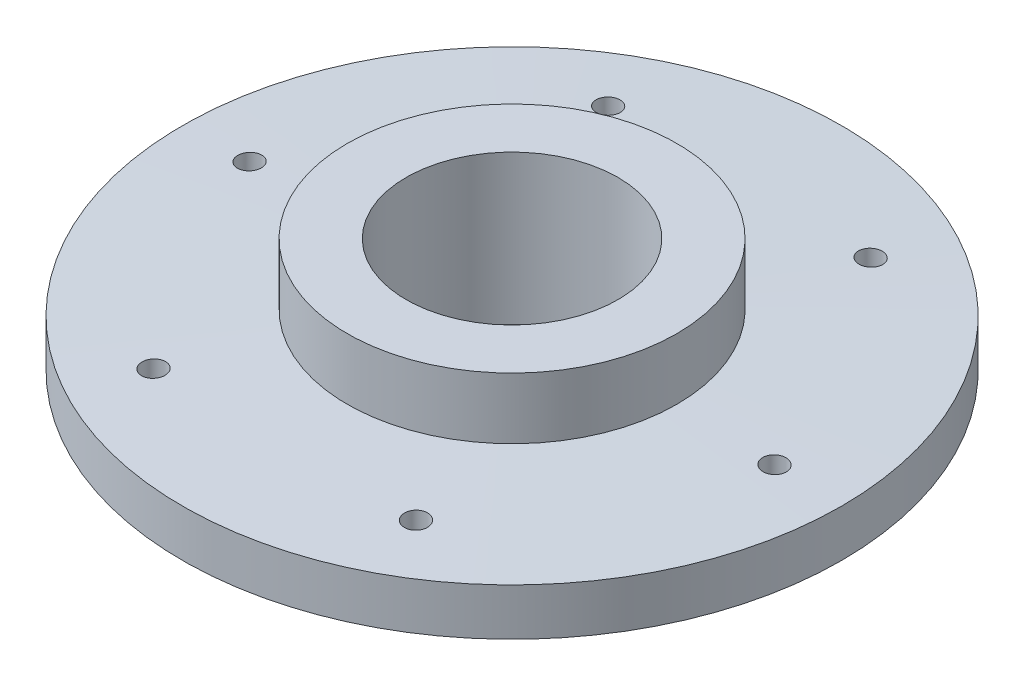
ISO-10303-21;
HEADER;
FILE_DESCRIPTION(('STEP AP214'),'2;1');
FILE_NAME('part.step','',(''),(''),'','','');
FILE_SCHEMA(('AUTOMOTIVE_DESIGN { 1 0 10303 214 1 1 1 1 }'));
ENDSEC;
DATA;
#1=APPLICATION_CONTEXT('core data for automotive mechanical design processes');
#2=APPLICATION_PROTOCOL_DEFINITION('international standard','automotive_design',2000,#1);
#3=PRODUCT_CONTEXT('',#1,'mechanical');
#4=PRODUCT('Part','Part','',(#3));
#5=PRODUCT_RELATED_PRODUCT_CATEGORY('part','',(#4));
#6=PRODUCT_DEFINITION_FORMATION('','',#4);
#7=PRODUCT_DEFINITION_CONTEXT('part definition',#1,'design');
#8=PRODUCT_DEFINITION('design','',#6,#7);
#9=PRODUCT_DEFINITION_SHAPE('','',#8);
#10=(LENGTH_UNIT() NAMED_UNIT(*) SI_UNIT(.MILLI.,.METRE.));
#11=(NAMED_UNIT(*) PLANE_ANGLE_UNIT() SI_UNIT($,.RADIAN.));
#12=(NAMED_UNIT(*) SI_UNIT($,.STERADIAN.) SOLID_ANGLE_UNIT());
#13=UNCERTAINTY_MEASURE_WITH_UNIT(LENGTH_MEASURE(1.E-05),#10,'distance_accuracy_value','');
#14=(GEOMETRIC_REPRESENTATION_CONTEXT(3) GLOBAL_UNCERTAINTY_ASSIGNED_CONTEXT((#13)) GLOBAL_UNIT_ASSIGNED_CONTEXT((#10,
#11,#12)) REPRESENTATION_CONTEXT('',''));
#15=CARTESIAN_POINT('',(0.,0.,0.));
#16=DIRECTION('',(0.,0.,1.));
#17=DIRECTION('',(1.,0.,0.));
#18=AXIS2_PLACEMENT_3D('',#15,#16,#17);
#19=CARTESIAN_POINT('',(0.,6.34444538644,0.));
#20=DIRECTION('',(0.,-1.,0.));
#21=DIRECTION('',(1.,0.,0.));
#22=AXIS2_PLACEMENT_3D('',#19,#20,#21);
#23=CYLINDRICAL_SURFACE('',#22,6.9999999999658);
#24=CARTESIAN_POINT('',(0.,6.34444538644,0.));
#25=DIRECTION('',(0.,-1.,0.));
#26=DIRECTION('',(1.,0.,0.));
#27=AXIS2_PLACEMENT_3D('',#24,#25,#26);
#28=CIRCLE('',#27,6.9999999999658);
#29=CARTESIAN_POINT('',(6.9999999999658,6.34444538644,0.));
#30=VERTEX_POINT('',#29);
#31=EDGE_CURVE('E10',#30,#30,#28,.T.);
#32=ORIENTED_EDGE('',*,*,#31,.T.);
#33=EDGE_LOOP('',(#32));
#34=FACE_BOUND('',#33,.T.);
#35=CARTESIAN_POINT('',(0.,3.7444453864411,0.));
#36=DIRECTION('',(0.,-1.,0.));
#37=DIRECTION('',(1.,0.,0.));
#38=AXIS2_PLACEMENT_3D('',#35,#36,#37);
#39=CIRCLE('',#38,6.9999999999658);
#40=CARTESIAN_POINT('',(6.9999999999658,3.7444453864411,0.));
#41=VERTEX_POINT('',#40);
#42=EDGE_CURVE('E79',#41,#41,#39,.T.);
#43=ORIENTED_EDGE('',*,*,#42,.F.);
#44=EDGE_LOOP('',(#43));
#45=FACE_BOUND('',#44,.T.);
#46=ADVANCED_FACE('F28',(#34,#45),#23,.T.);
#47=CARTESIAN_POINT('',(6.9999999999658,6.34444538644,0.));
#48=DIRECTION('',(0.,1.,0.));
#49=DIRECTION('',(-1.,0.,0.));
#50=AXIS2_PLACEMENT_3D('',#47,#48,#49);
#51=PLANE('',#50);
#52=CARTESIAN_POINT('',(0.,6.34444538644,0.));
#53=DIRECTION('',(0.,-1.,0.));
#54=DIRECTION('',(0.,0.,-1.));
#55=AXIS2_PLACEMENT_3D('',#52,#53,#54);
#56=CIRCLE('',#55,4.5);
#57=CARTESIAN_POINT('',(0.,6.34444538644,-4.5));
#58=VERTEX_POINT('',#57);
#59=EDGE_CURVE('E203',#58,#58,#56,.T.);
#60=ORIENTED_EDGE('',*,*,#59,.T.);
#61=EDGE_LOOP('',(#60));
#62=FACE_BOUND('',#61,.T.);
#63=ORIENTED_EDGE('',*,*,#31,.F.);
#64=EDGE_LOOP('',(#63));
#65=FACE_BOUND('',#64,.T.);
#66=ADVANCED_FACE('F152',(#62,#65),#51,.T.);
#67=CARTESIAN_POINT('',(0.,0.,0.));
#68=DIRECTION('',(0.,-1.,0.));
#69=DIRECTION('',(1.,0.,0.));
#70=AXIS2_PLACEMENT_3D('',#67,#68,#69);
#71=PLANE('',#70);
#72=CARTESIAN_POINT('',(0.,0.,0.));
#73=DIRECTION('',(0.,-1.,0.));
#74=DIRECTION('',(0.,0.,-1.));
#75=AXIS2_PLACEMENT_3D('',#72,#73,#74);
#76=CIRCLE('',#75,4.5);
#77=CARTESIAN_POINT('',(0.,0.,-4.5));
#78=VERTEX_POINT('',#77);
#79=EDGE_CURVE('E206',#78,#78,#76,.T.);
#80=ORIENTED_EDGE('',*,*,#79,.F.);
#81=EDGE_LOOP('',(#80));
#82=FACE_BOUND('',#81,.T.);
#83=CARTESIAN_POINT('',(0.,0.,0.));
#84=DIRECTION('',(0.,-1.,0.));
#85=DIRECTION('',(1.,0.,0.));
#86=AXIS2_PLACEMENT_3D('',#83,#84,#85);
#87=CIRCLE('',#86,7.9999999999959);
#88=CARTESIAN_POINT('',(7.9999999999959,0.,0.));
#89=VERTEX_POINT('',#88);
#90=EDGE_CURVE('E39',#89,#89,#87,.T.);
#91=ORIENTED_EDGE('',*,*,#90,.T.);
#92=EDGE_LOOP('',(#91));
#93=FACE_BOUND('',#92,.T.);
#94=ADVANCED_FACE('F89',(#82,#93),#71,.T.);
#95=CARTESIAN_POINT('',(0.,0.,0.));
#96=DIRECTION('',(0.,1.,0.));
#97=DIRECTION('',(-1.,0.,0.));
#98=AXIS2_PLACEMENT_3D('',#95,#96,#97);
#99=CONICAL_SURFACE('',#98,7.9999999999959,1.32581766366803);
#100=CARTESIAN_POINT('',(-5.92556493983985,0.908677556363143,-10.0127000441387));
#101=CARTESIAN_POINT('',(-5.9060851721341,0.910318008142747,-10.0318529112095));
#102=CARTESIAN_POINT('',(-5.88499614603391,0.91143955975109,-10.0494402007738));
#103=CARTESIAN_POINT('',(-5.84018806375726,0.912608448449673,-10.080950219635));
#104=CARTESIAN_POINT('',(-5.81646624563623,0.912654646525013,-10.0948690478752));
#105=CARTESIAN_POINT('',(-5.76709231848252,0.911669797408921,-10.1186228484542));
#106=CARTESIAN_POINT('',(-5.74144116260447,0.910639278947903,-10.1284598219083));
#107=CARTESIAN_POINT('',(-5.68894148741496,0.907532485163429,-10.1437949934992));
#108=CARTESIAN_POINT('',(-5.66209320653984,0.905456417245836,-10.1492940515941));
#109=CARTESIAN_POINT('',(-5.60787460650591,0.900311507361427,-10.1558502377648));
#110=CARTESIAN_POINT('',(-5.58050298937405,0.897239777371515,-10.1568943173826));
#111=CARTESIAN_POINT('',(-5.52607137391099,0.89019221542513,-10.1545288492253));
#112=CARTESIAN_POINT('',(-5.49901140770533,0.88621629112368,-10.1511188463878));
#113=CARTESIAN_POINT('',(-5.44542847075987,0.877386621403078,-10.1398922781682));
#114=CARTESIAN_POINT('',(-5.41892503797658,0.872517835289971,-10.131994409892));
#115=CARTESIAN_POINT('',(-5.36769354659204,0.862086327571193,-10.1120125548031));
#116=CARTESIAN_POINT('',(-5.34296571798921,0.856523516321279,-10.0999280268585));
#117=CARTESIAN_POINT('',(-5.29527616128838,0.844690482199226,-10.071568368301));
#118=CARTESIAN_POINT('',(-5.27238037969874,0.838405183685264,-10.0551886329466));
#119=CARTESIAN_POINT('',(-5.22971610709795,0.825422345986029,-10.018900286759));
#120=CARTESIAN_POINT('',(-5.20994804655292,0.818724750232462,-9.99899119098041));
#121=CARTESIAN_POINT('',(-5.17358995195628,0.804920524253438,-9.95566534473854));
#122=CARTESIAN_POINT('',(-5.15709207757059,0.797807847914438,-9.93217313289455));
#123=CARTESIAN_POINT('',(-5.12835179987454,0.783526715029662,-9.88272965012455));
#124=CARTESIAN_POINT('',(-5.11610981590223,0.776358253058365,-9.85677813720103));
#125=CARTESIAN_POINT('',(-5.096100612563,0.762075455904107,-9.80279269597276));
#126=CARTESIAN_POINT('',(-5.08839150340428,0.754962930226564,-9.77473671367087));
#127=CARTESIAN_POINT('',(-5.07794124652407,0.741095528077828,-9.71762629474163));
#128=CARTESIAN_POINT('',(-5.07520009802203,0.734340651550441,-9.68857185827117));
#129=CARTESIAN_POINT('',(-5.0748223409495,0.721443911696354,-9.63049664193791));
#130=CARTESIAN_POINT('',(-5.07715146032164,0.715298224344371,-9.60147695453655));
#131=CARTESIAN_POINT('',(-5.08685030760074,0.703773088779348,-9.54413378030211));
#132=CARTESIAN_POINT('',(-5.09421940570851,0.698393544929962,-9.5158102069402));
#133=CARTESIAN_POINT('',(-5.11361155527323,0.688714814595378,-9.46141748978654));
#134=CARTESIAN_POINT('',(-5.12551500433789,0.684392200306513,-9.43530991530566));
#135=CARTESIAN_POINT('',(-5.15369544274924,0.676818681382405,-9.3854006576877));
#136=CARTESIAN_POINT('',(-5.16997156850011,0.673567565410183,-9.36159852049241));
#137=CARTESIAN_POINT('',(-5.20586963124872,0.668348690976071,-9.31777590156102));
#138=CARTESIAN_POINT('',(-5.22536879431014,0.666343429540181,-9.2976592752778));
#139=CARTESIAN_POINT('',(-5.26750099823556,0.663534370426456,-9.26093014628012));
#140=CARTESIAN_POINT('',(-5.290133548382,0.662730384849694,-9.24431709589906));
#141=CARTESIAN_POINT('',(-5.33731418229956,0.662359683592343,-9.21544191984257));
#142=CARTESIAN_POINT('',(-5.36180630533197,0.662764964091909,-9.20308859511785));
#143=CARTESIAN_POINT('',(-5.41243735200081,0.664736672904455,-9.18255941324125));
#144=CARTESIAN_POINT('',(-5.43857620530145,0.666303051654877,-9.17438337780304));
#145=CARTESIAN_POINT('',(-5.4916770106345,0.670532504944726,-9.1624261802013));
#146=CARTESIAN_POINT('',(-5.51863653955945,0.673192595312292,-9.15863316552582));
#147=CARTESIAN_POINT('',(-5.57269574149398,0.67951411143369,-9.15545577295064));
#148=CARTESIAN_POINT('',(-5.59979542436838,0.683175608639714,-9.15607170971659));
#149=CARTESIAN_POINT('',(-5.65389951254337,0.69145158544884,-9.16168552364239));
#150=CARTESIAN_POINT('',(-5.68089311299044,0.696082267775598,-9.16676332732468));
#151=CARTESIAN_POINT('',(-5.73355931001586,0.706102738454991,-9.18120444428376));
#152=CARTESIAN_POINT('',(-5.75923172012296,0.711492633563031,-9.19056836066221));
#153=CARTESIAN_POINT('',(-5.80935219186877,0.723039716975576,-9.21361965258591));
#154=CARTESIAN_POINT('',(-5.83374003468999,0.729215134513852,-9.22742882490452));
#155=CARTESIAN_POINT('',(-5.87979853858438,0.742013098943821,-9.25884792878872));
#156=CARTESIAN_POINT('',(-5.90146877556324,0.748635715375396,-9.27645845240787));
#157=CARTESIAN_POINT('',(-5.94211281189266,0.762333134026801,-9.31552954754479));
#158=CARTESIAN_POINT('',(-5.96099302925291,0.769415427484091,-9.33708491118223));
#159=CARTESIAN_POINT('',(-5.99479762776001,0.783655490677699,-9.38308110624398));
#160=CARTESIAN_POINT('',(-6.00972159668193,0.790813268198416,-9.40752223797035));
#161=CARTESIAN_POINT('',(-6.03538157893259,0.805109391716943,-9.45898502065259));
#162=CARTESIAN_POINT('',(-6.04605473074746,0.812245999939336,-9.48603854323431));
#163=CARTESIAN_POINT('',(-6.0625720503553,0.826194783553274,-9.54166202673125));
#164=CARTESIAN_POINT('',(-6.06841638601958,0.833006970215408,-9.57023193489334));
#165=CARTESIAN_POINT('',(-6.07503889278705,0.846078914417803,-9.62791270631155));
#166=CARTESIAN_POINT('',(-6.07584461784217,0.852341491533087,-9.65701975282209));
#167=CARTESIAN_POINT('',(-6.07236972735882,0.864177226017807,-9.71508049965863));
#168=CARTESIAN_POINT('',(-6.06808836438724,0.869750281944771,-9.74403417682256));
#169=CARTESIAN_POINT('',(-6.05463907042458,0.879928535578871,-9.80028427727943));
#170=CARTESIAN_POINT('',(-6.04557756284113,0.884551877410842,-9.82760289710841));
#171=CARTESIAN_POINT('',(-6.02283972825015,0.892834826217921,-9.88037665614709));
#172=CARTESIAN_POINT('',(-6.00916996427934,0.896495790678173,-9.90583438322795));
#173=CARTESIAN_POINT('',(-5.983626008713,0.901552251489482,-9.94487640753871));
#174=CARTESIAN_POINT('',(-5.97305466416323,0.903279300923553,-9.95928670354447));
#175=CARTESIAN_POINT('',(-5.95040759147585,0.906304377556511,-9.9869221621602));
#176=CARTESIAN_POINT('',(-5.93833188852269,0.907602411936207,-10.0001473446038));
#177=CARTESIAN_POINT('',(-5.92556493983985,0.908677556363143,-10.0127000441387));
#178=B_SPLINE_CURVE_WITH_KNOTS('',3,(#100,#101,#102,#103,#104,#105,#106,#107,#108,#109,#110,
#111,#112,#113,#114,#115,#116,#117,#118,#119,#120,#121,#122,#123,#124,#125,#126,#127,#128,#129,
#130,#131,#132,#133,#134,#135,#136,#137,#138,#139,#140,#141,#142,#143,#144,#145,#146,#147,#148,
#149,#150,#151,#152,#153,#154,#155,#156,#157,#158,#159,#160,#161,#162,#163,#164,#165,#166,#167,
#168,#169,#170,#171,#172,#173,#174,#175,#176,#177),.UNSPECIFIED.,.T.,.F.,(4,2,2,2,2,2,2,2,2,2,2,
2,2,2,2,2,2,2,2,2,2,2,2,2,2,2,2,2,2,2,2,2,2,2,2,2,2,2,4),(0.,0.0820374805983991,
0.164161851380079,0.246245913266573,0.328313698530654,0.410621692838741,0.492938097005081,
0.576795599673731,0.660663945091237,0.74680309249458,0.83295408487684,0.921266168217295,
1.00958695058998,1.09901659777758,1.18844623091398,1.27727324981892,1.36608917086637,
1.45270861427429,1.53931096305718,1.62316097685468,1.70699787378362,1.78890848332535,
1.87081559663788,1.95250069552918,2.03419162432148,2.11737643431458,2.20057295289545,
2.28627688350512,2.37199417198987,2.46013545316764,2.54828591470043,2.63769543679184,
2.72710185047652,2.81601890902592,2.90494903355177,2.99197798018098,3.07888350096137,
3.1326513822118,3.18641836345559),.UNSPECIFIED.);
#179=CARTESIAN_POINT('',(-5.92556493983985,0.908677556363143,-10.0127000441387));
#180=VERTEX_POINT('',#179);
#181=EDGE_CURVE('E113',#180,#180,#178,.T.);
#182=ORIENTED_EDGE('',*,*,#181,.F.);
#183=EDGE_LOOP('',(#182));
#184=FACE_BOUND('',#183,.T.);
#185=CARTESIAN_POINT('',(5.21669136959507,0.667424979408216,9.30744986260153));
#186=CARTESIAN_POINT('',(5.23564313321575,0.665495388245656,9.28797942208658));
#187=CARTESIAN_POINT('',(5.25622610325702,0.664117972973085,9.27001672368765));
#188=CARTESIAN_POINT('',(5.30008703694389,0.662522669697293,9.23765361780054));
#189=CARTESIAN_POINT('',(5.32336767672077,0.662305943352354,9.22325679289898));
#190=CARTESIAN_POINT('',(5.37194075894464,0.663042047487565,9.19846074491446));
#191=CARTESIAN_POINT('',(5.39723233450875,0.66399437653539,9.18805981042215));
#192=CARTESIAN_POINT('',(5.44910220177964,0.66703177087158,9.17152797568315));
#193=CARTESIAN_POINT('',(5.47568025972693,0.669116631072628,9.16539630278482));
#194=CARTESIAN_POINT('',(5.52944510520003,0.674349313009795,9.15752018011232));
#195=CARTESIAN_POINT('',(5.55663329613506,0.677499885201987,9.15578718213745));
#196=CARTESIAN_POINT('',(5.61080416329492,0.684752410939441,9.15673136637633));
#197=CARTESIAN_POINT('',(5.6377868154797,0.688854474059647,9.15940905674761));
#198=CARTESIAN_POINT('',(5.69142278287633,0.697975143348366,9.16914635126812));
#199=CARTESIAN_POINT('',(5.71805558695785,0.703012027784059,9.17630163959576));
#200=CARTESIAN_POINT('',(5.76966625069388,0.713777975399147,9.19481890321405));
#201=CARTESIAN_POINT('',(5.79464386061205,0.719507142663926,9.20618151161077));
#202=CARTESIAN_POINT('',(5.84305698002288,0.731673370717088,9.2331737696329));
#203=CARTESIAN_POINT('',(5.86642076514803,0.73812686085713,9.24892468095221));
#204=CARTESIAN_POINT('',(5.91012133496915,0.75139868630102,9.28405424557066));
#205=CARTESIAN_POINT('',(5.93045767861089,0.758217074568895,9.3034334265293));
#206=CARTESIAN_POINT('',(5.96806585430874,0.772208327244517,9.34582446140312));
#207=CARTESIAN_POINT('',(5.9852446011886,0.779385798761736,9.3689174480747));
#208=CARTESIAN_POINT('',(6.01539979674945,0.793723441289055,9.41770757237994));
#209=CARTESIAN_POINT('',(6.02837589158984,0.80088361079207,9.44340492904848));
#210=CARTESIAN_POINT('',(6.0498556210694,0.815059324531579,9.49695843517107));
#211=CARTESIAN_POINT('',(6.05831388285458,0.822072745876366,9.52483337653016));
#212=CARTESIAN_POINT('',(6.07027876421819,0.835684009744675,9.58172634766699));
#213=CARTESIAN_POINT('',(6.07378550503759,0.842281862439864,9.61074434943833));
#214=CARTESIAN_POINT('',(6.07567552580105,0.854811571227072,9.6687933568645));
#215=CARTESIAN_POINT('',(6.07410878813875,0.860749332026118,9.69782143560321));
#216=CARTESIAN_POINT('',(6.06593419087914,0.871860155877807,9.75531047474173));
#217=CARTESIAN_POINT('',(6.05932697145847,0.877033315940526,9.78377150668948));
#218=CARTESIAN_POINT('',(6.04141898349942,0.886343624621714,9.83856698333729));
#219=CARTESIAN_POINT('',(6.03023684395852,0.890502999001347,9.86493639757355));
#220=CARTESIAN_POINT('',(6.00346249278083,0.897820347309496,9.9154851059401));
#221=CARTESIAN_POINT('',(5.98787102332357,0.90097848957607,9.93966476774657));
#222=CARTESIAN_POINT('',(5.95319632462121,0.90612219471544,9.98443131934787));
#223=CARTESIAN_POINT('',(5.9342226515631,0.908138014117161,10.0050996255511));
#224=CARTESIAN_POINT('',(5.89304115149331,0.911069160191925,10.043007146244));
#225=CARTESIAN_POINT('',(5.87083374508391,0.911984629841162,10.0602468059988));
#226=CARTESIAN_POINT('',(5.82429344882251,0.912680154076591,10.0904732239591));
#227=CARTESIAN_POINT('',(5.80001039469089,0.912481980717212,10.1035362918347));
#228=CARTESIAN_POINT('',(5.74965813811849,0.911006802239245,10.1254899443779));
#229=CARTESIAN_POINT('',(5.72358901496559,0.909729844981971,10.1343807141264));
#230=CARTESIAN_POINT('',(5.67050921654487,0.906141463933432,10.1477363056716));
#231=CARTESIAN_POINT('',(5.64350216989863,0.903833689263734,10.1522165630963));
#232=CARTESIAN_POINT('',(5.58921942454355,0.898251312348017,10.1567226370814));
#233=CARTESIAN_POINT('',(5.56194371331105,0.894976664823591,10.1567482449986));
#234=CARTESIAN_POINT('',(5.50750731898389,0.887502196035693,10.152368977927));
#235=CARTESIAN_POINT('',(5.480353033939,0.883290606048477,10.147904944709));
#236=CARTESIAN_POINT('',(5.4272647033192,0.874084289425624,10.1346423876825));
#237=CARTESIAN_POINT('',(5.40133079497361,0.869089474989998,10.1258433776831));
#238=CARTESIAN_POINT('',(5.35072807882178,0.858315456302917,10.1039343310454));
#239=CARTESIAN_POINT('',(5.32610701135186,0.852519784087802,10.0907221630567));
#240=CARTESIAN_POINT('',(5.2794891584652,0.840398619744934,10.0604676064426));
#241=CARTESIAN_POINT('',(5.25749274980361,0.834073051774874,10.0434246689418));
#242=CARTESIAN_POINT('',(5.2161230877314,0.820878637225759,10.005491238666));
#243=CARTESIAN_POINT('',(5.19683732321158,0.813999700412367,9.98450880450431));
#244=CARTESIAN_POINT('',(5.16212305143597,0.80004002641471,9.93962261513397));
#245=CARTESIAN_POINT('',(5.1466950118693,0.792959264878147,9.91571850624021));
#246=CARTESIAN_POINT('',(5.11985926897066,0.778654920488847,9.86518180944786));
#247=CARTESIAN_POINT('',(5.10853129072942,0.771431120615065,9.83850689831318));
#248=CARTESIAN_POINT('',(5.09063315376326,0.75717799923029,9.78355582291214));
#249=CARTESIAN_POINT('',(5.08406302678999,0.750148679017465,9.75527964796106));
#250=CARTESIAN_POINT('',(5.07589964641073,0.736486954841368,9.69789201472));
#251=CARTESIAN_POINT('',(5.07431121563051,0.729854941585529,9.66877977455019));
#252=CARTESIAN_POINT('',(5.07623367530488,0.717204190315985,9.61057937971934));
#253=CARTESIAN_POINT('',(5.07974545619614,0.71118555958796,9.58149123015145));
#254=CARTESIAN_POINT('',(5.09173012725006,0.700070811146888,9.52474368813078));
#255=CARTESIAN_POINT('',(5.10011209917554,0.694959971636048,9.49706796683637));
#256=CARTESIAN_POINT('',(5.12158953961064,0.685716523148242,9.44346233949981));
#257=CARTESIAN_POINT('',(5.13467823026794,0.68158252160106,9.41752998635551));
#258=CARTESIAN_POINT('',(5.15945162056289,0.675791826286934,9.37753154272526));
#259=CARTESIAN_POINT('',(5.16980686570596,0.673788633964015,9.36267622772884));
#260=CARTESIAN_POINT('',(5.19209584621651,0.670249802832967,9.33413957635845));
#261=CARTESIAN_POINT('',(5.20402954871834,0.66871415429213,9.32045821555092));
#262=CARTESIAN_POINT('',(5.21669136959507,0.667424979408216,9.30744986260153));
#263=B_SPLINE_CURVE_WITH_KNOTS('',3,(#185,#186,#187,#188,#189,#190,#191,#192,#193,#194,#195,
#196,#197,#198,#199,#200,#201,#202,#203,#204,#205,#206,#207,#208,#209,#210,#211,#212,#213,#214,
#215,#216,#217,#218,#219,#220,#221,#222,#223,#224,#225,#226,#227,#228,#229,#230,#231,#232,#233,
#234,#235,#236,#237,#238,#239,#240,#241,#242,#243,#244,#245,#246,#247,#248,#249,#250,#251,#252,
#253,#254,#255,#256,#257,#258,#259,#260,#261,#262),.UNSPECIFIED.,.T.,.F.,(4,2,2,2,2,2,2,2,2,2,2,
2,2,2,2,2,2,2,2,2,2,2,2,2,2,2,2,2,2,2,2,2,2,2,2,2,2,2,4),(0.,0.0816525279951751,
0.163386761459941,0.24508594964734,0.326770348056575,0.408667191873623,0.490573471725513,
0.574292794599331,0.658024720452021,0.744350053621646,0.830687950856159,0.919263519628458,
1.00784654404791,1.09730323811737,1.18675774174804,1.27533365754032,1.36389832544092,
1.45029896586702,1.5366850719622,1.62066101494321,1.70462604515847,1.786955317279,
1.86928093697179,1.95131740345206,2.03335771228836,2.11649338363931,2.19963838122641,
2.28485889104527,2.37009161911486,2.45763966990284,2.54519832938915,2.63437813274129,
2.72355853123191,2.8128252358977,2.90210752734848,2.98977430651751,3.07731534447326,
3.13186917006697,3.1864218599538),.UNSPECIFIED.);
#264=CARTESIAN_POINT('',(5.21669136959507,0.667424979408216,9.30744986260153));
#265=VERTEX_POINT('',#264);
#266=EDGE_CURVE('E106',#265,#265,#263,.T.);
#267=ORIENTED_EDGE('',*,*,#266,.F.);
#268=EDGE_LOOP('',(#267));
#269=FACE_BOUND('',#268,.T.);
#270=CARTESIAN_POINT('',(10.8048664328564,0.702730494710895,-0.361777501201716));
#271=CARTESIAN_POINT('',(10.8256743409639,0.708095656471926,-0.381626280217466));
#272=CARTESIAN_POINT('',(10.8481612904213,0.713877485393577,-0.399639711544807));
#273=CARTESIAN_POINT('',(10.895788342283,0.72607973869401,-0.4315088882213));
#274=CARTESIAN_POINT('',(10.9209326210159,0.73250116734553,-0.445357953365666));
#275=CARTESIAN_POINT('',(10.9730790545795,0.745767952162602,-0.468520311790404));
#276=CARTESIAN_POINT('',(11.0000783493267,0.752612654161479,-0.477840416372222));
#277=CARTESIAN_POINT('',(11.0551998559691,0.76653247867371,-0.491752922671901));
#278=CARTESIAN_POINT('',(11.0833217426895,0.773607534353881,-0.496346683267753));
#279=CARTESIAN_POINT('',(11.1403848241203,0.787908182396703,-0.500738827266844));
#280=CARTESIAN_POINT('',(11.169331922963,0.795134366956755,-0.500458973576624));
#281=CARTESIAN_POINT('',(11.2267890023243,0.809422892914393,-0.49491069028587));
#282=CARTESIAN_POINT('',(11.2552989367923,0.816485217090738,-0.489641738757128));
#283=CARTESIAN_POINT('',(11.3111371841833,0.830267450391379,-0.474210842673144));
#284=CARTESIAN_POINT('',(11.3384622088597,0.836986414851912,-0.46403612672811));
#285=CARTESIAN_POINT('',(11.3910361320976,0.849871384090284,-0.439031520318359));
#286=CARTESIAN_POINT('',(11.416285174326,0.856037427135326,-0.424201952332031));
#287=CARTESIAN_POINT('',(11.463534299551,0.867542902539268,-0.390543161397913));
#288=CARTESIAN_POINT('',(11.4855803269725,0.872894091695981,-0.371782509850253));
#289=CARTESIAN_POINT('',(11.526197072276,0.88272963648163,-0.330622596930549));
#290=CARTESIAN_POINT('',(11.5447683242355,0.887214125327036,-0.308223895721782));
#291=CARTESIAN_POINT('',(11.5773630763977,0.8950705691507,-0.261074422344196));
#292=CARTESIAN_POINT('',(11.5914964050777,0.89846943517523,-0.236404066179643));
#293=CARTESIAN_POINT('',(11.6154118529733,0.904213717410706,-0.184924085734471));
#294=CARTESIAN_POINT('',(11.6251946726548,0.906559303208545,-0.15811480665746));
#295=CARTESIAN_POINT('',(11.6398772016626,0.910077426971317,-0.103871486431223));
#296=CARTESIAN_POINT('',(11.6448975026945,0.911278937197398,-0.0764719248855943));
#297=CARTESIAN_POINT('',(11.650321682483,0.912577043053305,-0.0211947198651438));
#298=CARTESIAN_POINT('',(11.6507260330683,0.912673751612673,0.0066828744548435));
#299=CARTESIAN_POINT('',(11.6469328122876,0.911766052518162,0.0617055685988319));
#300=CARTESIAN_POINT('',(11.6428003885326,0.910777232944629,0.088855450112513));
#301=CARTESIAN_POINT('',(11.6301736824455,0.907752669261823,0.142058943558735));
#302=CARTESIAN_POINT('',(11.6216794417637,0.905716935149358,0.168112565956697));
#303=CARTESIAN_POINT('',(11.6005719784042,0.900650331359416,0.218478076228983));
#304=CARTESIAN_POINT('',(11.5879468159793,0.897616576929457,0.242784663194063));
#305=CARTESIAN_POINT('',(11.5589797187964,0.89064159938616,0.28892526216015));
#306=CARTESIAN_POINT('',(11.5426375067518,0.886700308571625,0.310759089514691));
#307=CARTESIAN_POINT('',(11.5063927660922,0.877937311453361,0.351776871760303));
#308=CARTESIAN_POINT('',(11.4864300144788,0.873100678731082,0.37090438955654));
#309=CARTESIAN_POINT('',(11.4437452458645,0.862728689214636,0.405548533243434));
#310=CARTESIAN_POINT('',(11.4210228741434,0.857193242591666,0.42106469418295));
#311=CARTESIAN_POINT('',(11.3728122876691,0.845410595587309,0.448491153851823));
#312=CARTESIAN_POINT('',(11.3472659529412,0.839148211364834,0.460292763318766));
#313=CARTESIAN_POINT('',(11.2946538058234,0.826204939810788,0.479436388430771));
#314=CARTESIAN_POINT('',(11.2675877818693,0.819523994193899,0.486777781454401));
#315=CARTESIAN_POINT('',(11.2119757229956,0.80574562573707,0.496968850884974));
#316=CARTESIAN_POINT('',(11.1834095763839,0.798641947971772,0.499700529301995));
#317=CARTESIAN_POINT('',(11.1262443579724,0.784371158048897,0.500252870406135));
#318=CARTESIAN_POINT('',(11.0976452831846,0.777204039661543,0.498073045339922));
#319=CARTESIAN_POINT('',(11.040839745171,0.762913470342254,0.48879728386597));
#320=CARTESIAN_POINT('',(11.0126430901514,0.755791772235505,0.481638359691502));
#321=CARTESIAN_POINT('',(10.9578373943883,0.741897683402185,0.462510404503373));
#322=CARTESIAN_POINT('',(10.9312283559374,0.735125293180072,0.45054136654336));
#323=CARTESIAN_POINT('',(10.880551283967,0.722182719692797,0.422179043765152));
#324=CARTESIAN_POINT('',(10.8564682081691,0.716008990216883,0.405814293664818));
#325=CARTESIAN_POINT('',(10.8113989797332,0.70442040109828,0.369045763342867));
#326=CARTESIAN_POINT('',(10.7904124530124,0.699005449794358,0.348642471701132));
#327=CARTESIAN_POINT('',(10.7526944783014,0.689248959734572,0.304896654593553));
#328=CARTESIAN_POINT('',(10.7358715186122,0.684884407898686,0.28163821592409));
#329=CARTESIAN_POINT('',(10.7063944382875,0.677222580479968,0.232455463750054));
#330=CARTESIAN_POINT('',(10.6937395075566,0.673925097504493,0.206531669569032));
#331=CARTESIAN_POINT('',(10.673374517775,0.668612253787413,0.153641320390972));
#332=CARTESIAN_POINT('',(10.6655201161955,0.666559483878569,0.126734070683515));
#333=CARTESIAN_POINT('',(10.654411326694,0.663654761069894,0.0719254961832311));
#334=CARTESIAN_POINT('',(10.6511560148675,0.662802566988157,0.044024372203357));
#335=CARTESIAN_POINT('',(10.6493799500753,0.662337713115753,-0.0112820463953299));
#336=CARTESIAN_POINT('',(10.6507502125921,0.66269652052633,-0.0386836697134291));
#337=CARTESIAN_POINT('',(10.6579397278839,0.66457747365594,-0.0928623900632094));
#338=CARTESIAN_POINT('',(10.6637599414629,0.666099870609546,-0.119639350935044));
#339=CARTESIAN_POINT('',(10.6796307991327,0.670245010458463,-0.171734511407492));
#340=CARTESIAN_POINT('',(10.6896701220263,0.67286480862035,-0.197056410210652));
#341=CARTESIAN_POINT('',(10.7136475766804,0.679108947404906,-0.245618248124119));
#342=CARTESIAN_POINT('',(10.7275811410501,0.682732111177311,-0.268860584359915));
#343=CARTESIAN_POINT('',(10.7523925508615,0.68916742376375,-0.303573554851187));
#344=CARTESIAN_POINT('',(10.7621374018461,0.691691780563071,-0.315925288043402));
#345=CARTESIAN_POINT('',(10.7827111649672,0.697013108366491,-0.339625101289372));
#346=CARTESIAN_POINT('',(10.7935400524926,0.699810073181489,-0.350973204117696));
#347=CARTESIAN_POINT('',(10.8048664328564,0.702730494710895,-0.361777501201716));
#348=B_SPLINE_CURVE_WITH_KNOTS('',3,(#270,#271,#272,#273,#274,#275,#276,#277,#278,#279,#280,
#281,#282,#283,#284,#285,#286,#287,#288,#289,#290,#291,#292,#293,#294,#295,#296,#297,#298,#299,
#300,#301,#302,#303,#304,#305,#306,#307,#308,#309,#310,#311,#312,#313,#314,#315,#316,#317,#318,
#319,#320,#321,#322,#323,#324,#325,#326,#327,#328,#329,#330,#331,#332,#333,#334,#335,#336,#337,
#338,#339,#340,#341,#342,#343,#344,#345,#346,#347),.UNSPECIFIED.,.T.,.F.,(4,2,2,2,2,2,2,2,2,2,2,
2,2,2,2,2,2,2,2,2,2,2,2,2,2,2,2,2,2,2,2,2,2,2,2,2,2,2,4),(0.,0.087698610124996,
0.175537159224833,0.263243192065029,0.350924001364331,0.440013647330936,0.52911261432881,
0.61844479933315,0.707770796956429,0.795652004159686,0.883519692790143,0.969000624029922,
1.05446778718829,1.1377080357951,1.22093977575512,1.3029917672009,1.38504297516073,
1.46733346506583,1.54963009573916,1.63344782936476,1.7172763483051,1.80336860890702,
1.88947288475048,1.97774955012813,2.0660349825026,2.15545807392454,2.24488129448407,
2.33373749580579,2.42258295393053,2.50925556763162,2.59591132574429,2.67981367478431,
2.76369916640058,2.84562213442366,2.92756279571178,3.00928497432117,3.09091170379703,
3.13864982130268,3.1863868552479),.UNSPECIFIED.);
#349=CARTESIAN_POINT('',(10.8048664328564,0.702730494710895,-0.361777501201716));
#350=VERTEX_POINT('',#349);
#351=EDGE_CURVE('E101',#350,#350,#348,.T.);
#352=ORIENTED_EDGE('',*,*,#351,.F.);
#353=EDGE_LOOP('',(#352));
#354=FACE_BOUND('',#353,.T.);
#355=CARTESIAN_POINT('',(5.21276308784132,0.819459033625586,-10.0008344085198));
#356=CARTESIAN_POINT('',(5.23230648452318,0.826270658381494,-10.0213734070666));
#357=CARTESIAN_POINT('',(5.25363894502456,0.832930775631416,-10.0402878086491));
#358=CARTESIAN_POINT('',(5.29932025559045,0.845763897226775,-10.0742895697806));
#359=CARTESIAN_POINT('',(5.32367223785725,0.851936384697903,-10.08937290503));
#360=CARTESIAN_POINT('',(5.37474051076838,0.863621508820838,-10.115220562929));
#361=CARTESIAN_POINT('',(5.40145821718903,0.869133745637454,-10.1259822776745));
#362=CARTESIAN_POINT('',(5.45648362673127,0.879332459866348,-10.1427847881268));
#363=CARTESIAN_POINT('',(5.48479084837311,0.884019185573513,-10.1488270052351));
#364=CARTESIAN_POINT('',(5.54159222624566,0.892343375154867,-10.1558696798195));
#365=CARTESIAN_POINT('',(5.5700713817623,0.895999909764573,-10.156968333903));
#366=CARTESIAN_POINT('',(5.62691642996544,0.902275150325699,-10.154293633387));
#367=CARTESIAN_POINT('',(5.65528233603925,0.904893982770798,-10.1505208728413));
#368=CARTESIAN_POINT('',(5.71028480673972,0.908956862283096,-10.1383349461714));
#369=CARTESIAN_POINT('',(5.73694733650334,0.910430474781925,-10.1300486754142));
#370=CARTESIAN_POINT('',(5.78855397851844,0.912272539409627,-10.1091396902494));
#371=CARTESIAN_POINT('',(5.81349828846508,0.912641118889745,-10.0965174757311));
#372=CARTESIAN_POINT('',(5.86054997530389,0.912265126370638,-10.0675377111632));
#373=CARTESIAN_POINT('',(5.88269643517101,0.911538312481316,-10.0512433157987));
#374=CARTESIAN_POINT('',(5.92399033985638,0.909025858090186,-10.0152866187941));
#375=CARTESIAN_POINT('',(5.94313785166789,0.90724024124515,-9.9956243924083));
#376=CARTESIAN_POINT('',(5.97793158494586,0.902660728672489,-9.95349318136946));
#377=CARTESIAN_POINT('',(5.99357506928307,0.8998660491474,-9.93102202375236));
#378=CARTESIAN_POINT('',(6.02094927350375,0.893348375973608,-9.88393542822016));
#379=CARTESIAN_POINT('',(6.03267973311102,0.889625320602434,-9.85931984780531));
#380=CARTESIAN_POINT('',(6.05212532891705,0.881283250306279,-9.80820817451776));
#381=CARTESIAN_POINT('',(6.05976940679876,0.876650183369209,-9.78168736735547));
#382=CARTESIAN_POINT('',(6.07059284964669,0.86665609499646,-9.7278842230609));
#383=CARTESIAN_POINT('',(6.07377166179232,0.861294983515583,-9.70060179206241));
#384=CARTESIAN_POINT('',(6.07566671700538,0.849835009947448,-9.64528252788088));
#385=CARTESIAN_POINT('',(6.0742625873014,0.843720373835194,-9.61724484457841));
#386=CARTESIAN_POINT('',(6.06682328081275,0.831034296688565,-9.56189703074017));
#387=CARTESIAN_POINT('',(6.06078745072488,0.824462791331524,-9.53458700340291));
#388=CARTESIAN_POINT('',(6.04407179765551,0.810858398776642,-9.48072002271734));
#389=CARTESIAN_POINT('',(6.03327513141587,0.803817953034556,-9.45420120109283));
#390=CARTESIAN_POINT('',(6.00734108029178,0.789626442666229,-9.40340958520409));
#391=CARTESIAN_POINT('',(5.99220323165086,0.782475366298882,-9.37913703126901));
#392=CARTESIAN_POINT('',(5.95774797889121,0.768152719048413,-9.33316427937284));
#393=CARTESIAN_POINT('',(5.93837173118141,0.760982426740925,-9.31150773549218));
#394=CARTESIAN_POINT('',(5.89610740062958,0.746939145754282,-9.27182631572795));
#395=CARTESIAN_POINT('',(5.87321925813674,0.740066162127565,-9.25380150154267));
#396=CARTESIAN_POINT('',(5.82465195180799,0.726854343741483,-9.22200230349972));
#397=CARTESIAN_POINT('',(5.7989838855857,0.72051355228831,-9.20821180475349));
#398=CARTESIAN_POINT('',(5.74550165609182,0.708544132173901,-9.18525255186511));
#399=CARTESIAN_POINT('',(5.71768772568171,0.702915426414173,-9.17608329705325));
#400=CARTESIAN_POINT('',(5.66137026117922,0.692685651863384,-9.16287020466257));
#401=CARTESIAN_POINT('',(5.63289659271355,0.688064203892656,-9.15871503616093));
#402=CARTESIAN_POINT('',(5.57551001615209,0.679859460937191,-9.15535859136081));
#403=CARTESIAN_POINT('',(5.5465971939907,0.676275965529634,-9.15615635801));
#404=CARTESIAN_POINT('',(5.49013371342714,0.670381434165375,-9.16264538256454));
#405=CARTESIAN_POINT('',(5.46256894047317,0.668033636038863,-9.16818059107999));
#406=CARTESIAN_POINT('',(5.40868859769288,0.664532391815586,-9.18382002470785));
#407=CARTESIAN_POINT('',(5.38237281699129,0.663378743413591,-9.19392347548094));
#408=CARTESIAN_POINT('',(5.33242864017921,0.66232474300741,-9.21810824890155));
#409=CARTESIAN_POINT('',(5.30874933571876,0.662393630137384,-9.23208324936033));
#410=CARTESIAN_POINT('',(5.26402041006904,0.663706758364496,-9.26370182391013));
#411=CARTESIAN_POINT('',(5.24297063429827,0.664950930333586,-9.28134518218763));
#412=CARTESIAN_POINT('',(5.2042013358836,0.668556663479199,-9.3196615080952));
#413=CARTESIAN_POINT('',(5.18646288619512,0.670911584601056,-9.34031597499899));
#414=CARTESIAN_POINT('',(5.15461943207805,0.676650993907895,-9.38412860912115));
#415=CARTESIAN_POINT('',(5.14051464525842,0.680035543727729,-9.4072869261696));
#416=CARTESIAN_POINT('',(5.11607928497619,0.687778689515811,-9.45582934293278));
#417=CARTESIAN_POINT('',(5.10581144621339,0.69215174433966,-9.48124268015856));
#418=CARTESIAN_POINT('',(5.08957920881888,0.701695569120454,-9.53326312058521));
#419=CARTESIAN_POINT('',(5.08361522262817,0.706866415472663,-9.55987033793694));
#420=CARTESIAN_POINT('',(5.07597221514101,0.718007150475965,-9.61435284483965));
#421=CARTESIAN_POINT('',(5.07442317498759,0.723995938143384,-9.64224248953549));
#422=CARTESIAN_POINT('',(5.07595957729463,0.736470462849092,-9.69778912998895));
#423=CARTESIAN_POINT('',(5.07904684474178,0.742956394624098,-9.72544602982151));
#424=CARTESIAN_POINT('',(5.0898894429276,0.756437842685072,-9.78060755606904));
#425=CARTESIAN_POINT('',(5.09778135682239,0.763442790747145,-9.80808299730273));
#426=CARTESIAN_POINT('',(5.11809884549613,0.777578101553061,-9.86124317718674));
#427=CARTESIAN_POINT('',(5.13051975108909,0.78470832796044,-9.88692972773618));
#428=CARTESIAN_POINT('',(5.15458250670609,0.796476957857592,-9.92747766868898));
#429=CARTESIAN_POINT('',(5.16504661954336,0.801136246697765,-9.94304438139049));
#430=CARTESIAN_POINT('',(5.1876667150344,0.810372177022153,-9.97292296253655));
#431=CARTESIAN_POINT('',(5.19982271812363,0.814948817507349,-9.98723481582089));
#432=CARTESIAN_POINT('',(5.21276308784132,0.819459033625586,-10.0008344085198));
#433=B_SPLINE_CURVE_WITH_KNOTS('',3,(#355,#356,#357,#358,#359,#360,#361,#362,#363,#364,#365,
#366,#367,#368,#369,#370,#371,#372,#373,#374,#375,#376,#377,#378,#379,#380,#381,#382,#383,#384,
#385,#386,#387,#388,#389,#390,#391,#392,#393,#394,#395,#396,#397,#398,#399,#400,#401,#402,#403,
#404,#405,#406,#407,#408,#409,#410,#411,#412,#413,#414,#415,#416,#417,#418,#419,#420,#421,#422,
#423,#424,#425,#426,#427,#428,#429,#430,#431,#432),.UNSPECIFIED.,.T.,.F.,(4,2,2,2,2,2,2,2,2,2,2,
2,2,2,2,2,2,2,2,2,2,2,2,2,2,2,2,2,2,2,2,2,2,2,2,2,2,2,4),(0.,0.0874057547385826,
0.174902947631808,0.262452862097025,0.349976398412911,0.435753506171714,0.5215201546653,
0.604991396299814,0.688453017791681,0.77057606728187,0.852697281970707,0.934882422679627,
1.01707302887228,1.10064984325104,1.18423700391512,1.27003710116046,1.35584930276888,
1.44389618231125,1.53195247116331,1.62131912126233,1.71068728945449,1.79971100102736,
1.88872506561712,1.97572401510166,2.06270615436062,2.14692877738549,2.2311371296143,
2.31322974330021,2.39531752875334,2.47692069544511,2.55852874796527,2.64141810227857,
2.72431539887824,2.80962927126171,2.89497673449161,2.98287167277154,3.07067625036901,
3.1285499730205,3.18642439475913),.UNSPECIFIED.);
#434=CARTESIAN_POINT('',(5.21276308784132,0.819459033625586,-10.0008344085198));
#435=VERTEX_POINT('',#434);
#436=EDGE_CURVE('E97',#435,#435,#433,.T.);
#437=ORIENTED_EDGE('',*,*,#436,.F.);
#438=EDGE_LOOP('',(#437));
#439=FACE_BOUND('',#438,.T.);
#440=CARTESIAN_POINT('',(-11.4903889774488,0.874056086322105,-0.366244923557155));
#441=CARTESIAN_POINT('',(-11.469371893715,0.868960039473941,-0.38577634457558));
#442=CARTESIAN_POINT('',(-11.4467047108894,0.863450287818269,-0.403461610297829));
#443=CARTESIAN_POINT('',(-11.3987821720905,0.851763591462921,-0.434657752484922));
#444=CARTESIAN_POINT('',(-11.3735228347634,0.845585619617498,-0.448162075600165));
#445=CARTESIAN_POINT('',(-11.3212206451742,0.832747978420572,-0.470629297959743));
#446=CARTESIAN_POINT('',(-11.2941805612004,0.826089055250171,-0.479599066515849));
#447=CARTESIAN_POINT('',(-11.2390569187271,0.812463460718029,-0.492820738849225));
#448=CARTESIAN_POINT('',(-11.2109736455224,0.805496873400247,-0.497073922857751));
#449=CARTESIAN_POINT('',(-11.1540435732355,0.791320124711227,-0.500810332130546));
#450=CARTESIAN_POINT('',(-11.1251918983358,0.78410783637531,-0.500211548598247));
#451=CARTESIAN_POINT('',(-11.0679982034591,0.769755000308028,-0.494067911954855));
#452=CARTESIAN_POINT('',(-11.0396562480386,0.762614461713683,-0.488522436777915));
#453=CARTESIAN_POINT('',(-10.9840925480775,0.748562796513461,-0.472563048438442));
#454=CARTESIAN_POINT('',(-10.956879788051,0.741653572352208,-0.46211610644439));
#455=CARTESIAN_POINT('',(-10.9045827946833,0.728328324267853,-0.436596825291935));
#456=CARTESIAN_POINT('',(-10.8794984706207,0.721912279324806,-0.421524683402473));
#457=CARTESIAN_POINT('',(-10.8325408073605,0.709863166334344,-0.38736488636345));
#458=CARTESIAN_POINT('',(-10.8106296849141,0.704220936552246,-0.368332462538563));
#459=CARTESIAN_POINT('',(-10.7703325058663,0.693816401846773,-0.326638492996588));
#460=CARTESIAN_POINT('',(-10.7519458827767,0.689053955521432,-0.303977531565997));
#461=CARTESIAN_POINT('',(-10.7197877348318,0.680706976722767,-0.256357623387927));
#462=CARTESIAN_POINT('',(-10.7058993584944,0.67709267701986,-0.231482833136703));
#463=CARTESIAN_POINT('',(-10.6825118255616,0.670997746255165,-0.179620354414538));
#464=CARTESIAN_POINT('',(-10.6730118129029,0.668516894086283,-0.152633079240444));
#465=CARTESIAN_POINT('',(-10.6589585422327,0.664844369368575,-0.0982042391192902));
#466=CARTESIAN_POINT('',(-10.6542624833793,0.663615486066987,-0.0708020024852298));
#467=CARTESIAN_POINT('',(-10.6494747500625,0.662362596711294,-0.0155721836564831));
#468=CARTESIAN_POINT('',(-10.6493825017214,0.662338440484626,0.012255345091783));
#469=CARTESIAN_POINT('',(-10.6537658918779,0.663485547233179,0.0670358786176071));
#470=CARTESIAN_POINT('',(-10.6581625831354,0.664636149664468,0.0939956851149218));
#471=CARTESIAN_POINT('',(-10.6712552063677,0.668058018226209,0.14677427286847));
#472=CARTESIAN_POINT('',(-10.6799511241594,0.670329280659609,0.172593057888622));
#473=CARTESIAN_POINT('',(-10.7014062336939,0.675922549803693,0.222496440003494));
#474=CARTESIAN_POINT('',(-10.7141834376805,0.679249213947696,0.246572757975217));
#475=CARTESIAN_POINT('',(-10.743387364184,0.686834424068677,0.292234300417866));
#476=CARTESIAN_POINT('',(-10.7598144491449,0.691093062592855,0.313819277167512));
#477=CARTESIAN_POINT('',(-10.7962532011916,0.700512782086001,0.354435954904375));
#478=CARTESIAN_POINT('',(-10.816339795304,0.705692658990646,0.373396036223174));
#479=CARTESIAN_POINT('',(-10.8592382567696,0.716719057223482,0.407691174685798));
#480=CARTESIAN_POINT('',(-10.8820505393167,0.722565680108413,0.423025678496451));
#481=CARTESIAN_POINT('',(-10.9305146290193,0.734942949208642,0.450134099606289));
#482=CARTESIAN_POINT('',(-10.9562326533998,0.741489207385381,0.46178253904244));
#483=CARTESIAN_POINT('',(-11.0091809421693,0.754915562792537,0.48058253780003));
#484=CARTESIAN_POINT('',(-11.0364114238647,0.761795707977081,0.487733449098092));
#485=CARTESIAN_POINT('',(-11.0923393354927,0.775872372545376,0.497494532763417));
#486=CARTESIAN_POINT('',(-11.1210564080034,0.783072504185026,0.499987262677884));
#487=CARTESIAN_POINT('',(-11.1785072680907,0.7974210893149,0.500012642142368));
#488=CARTESIAN_POINT('',(-11.207241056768,0.804569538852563,0.497544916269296));
#489=CARTESIAN_POINT('',(-11.2641520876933,0.818675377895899,0.487657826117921));
#490=CARTESIAN_POINT('',(-11.2923228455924,0.82563072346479,0.480198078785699));
#491=CARTESIAN_POINT('',(-11.3470380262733,0.839092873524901,0.460458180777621));
#492=CARTESIAN_POINT('',(-11.373582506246,0.845599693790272,0.448178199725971));
#493=CARTESIAN_POINT('',(-11.4239488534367,0.857907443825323,0.41926785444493));
#494=CARTESIAN_POINT('',(-11.4477982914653,0.863715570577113,0.402688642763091));
#495=CARTESIAN_POINT('',(-11.4923708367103,0.874541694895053,0.36554536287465));
#496=CARTESIAN_POINT('',(-11.5130943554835,0.879559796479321,0.344981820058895));
#497=CARTESIAN_POINT('',(-11.5502561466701,0.888539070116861,0.301003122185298));
#498=CARTESIAN_POINT('',(-11.5667893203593,0.892523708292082,0.277672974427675));
#499=CARTESIAN_POINT('',(-11.5956878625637,0.899477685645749,0.228422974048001));
#500=CARTESIAN_POINT('',(-11.6080539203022,0.902447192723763,0.202503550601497));
#501=CARTESIAN_POINT('',(-11.6279140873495,0.907211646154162,0.149582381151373));
#502=CARTESIAN_POINT('',(-11.635533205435,0.909036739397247,0.12263022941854));
#503=CARTESIAN_POINT('',(-11.6461706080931,0.911583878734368,0.0677841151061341));
#504=CARTESIAN_POINT('',(-11.6491896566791,0.912306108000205,0.0398903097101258));
#505=CARTESIAN_POINT('',(-11.6505129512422,0.912622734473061,-0.0154986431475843));
#506=CARTESIAN_POINT('',(-11.6489030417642,0.912237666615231,-0.0429916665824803));
#507=CARTESIAN_POINT('',(-11.6412052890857,0.910395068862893,-0.0973133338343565));
#508=CARTESIAN_POINT('',(-11.6351164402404,0.908937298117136,-0.124141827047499));
#509=CARTESIAN_POINT('',(-11.6186745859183,0.904995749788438,-0.176328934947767));
#510=CARTESIAN_POINT('',(-11.6083280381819,0.902513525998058,-0.201689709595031));
#511=CARTESIAN_POINT('',(-11.5837068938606,0.896596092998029,-0.250276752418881));
#512=CARTESIAN_POINT('',(-11.5694369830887,0.893162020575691,-0.273505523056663));
#513=CARTESIAN_POINT('',(-11.544053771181,0.887039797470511,-0.308179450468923));
#514=CARTESIAN_POINT('',(-11.5340768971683,0.884630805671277,-0.320523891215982));
#515=CARTESIAN_POINT('',(-11.5130296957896,0.879541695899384,-0.344180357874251));
#516=CARTESIAN_POINT('',(-11.5019593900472,0.876861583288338,-0.355492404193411));
#517=CARTESIAN_POINT('',(-11.4903889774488,0.874056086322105,-0.366244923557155));
#518=B_SPLINE_CURVE_WITH_KNOTS('',3,(#440,#441,#442,#443,#444,#445,#446,#447,#448,#449,#450,
#451,#452,#453,#454,#455,#456,#457,#458,#459,#460,#461,#462,#463,#464,#465,#466,#467,#468,#469,
#470,#471,#472,#473,#474,#475,#476,#477,#478,#479,#480,#481,#482,#483,#484,#485,#486,#487,#488,
#489,#490,#491,#492,#493,#494,#495,#496,#497,#498,#499,#500,#501,#502,#503,#504,#505,#506,#507,
#508,#509,#510,#511,#512,#513,#514,#515,#516,#517),.UNSPECIFIED.,.T.,.F.,(4,2,2,2,2,2,2,2,2,2,2,
2,2,2,2,2,2,2,2,2,2,2,2,2,2,2,2,2,2,2,2,2,2,2,2,2,2,2,4),(0.,0.0873609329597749,
0.174858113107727,0.262222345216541,0.349562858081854,0.438382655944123,0.527213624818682,
0.616651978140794,0.706086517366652,0.79434862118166,0.882596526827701,0.968323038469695,
1.0540328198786,1.13711348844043,1.22018380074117,1.30181789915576,1.38345172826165,
1.46545093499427,1.54745828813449,1.63138585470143,1.71532622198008,1.80187549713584,
1.88843723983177,1.97715338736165,2.06587624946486,2.15532565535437,2.2447719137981,
2.33319921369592,2.42161486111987,2.50780043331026,2.59397174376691,2.67776548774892,
2.7615453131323,2.84378150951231,2.92603617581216,3.00816654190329,3.09019923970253,
3.13829449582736,3.1863888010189),.UNSPECIFIED.);
#519=CARTESIAN_POINT('',(-11.4903889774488,0.874056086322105,-0.366244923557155));
#520=VERTEX_POINT('',#519);
#521=EDGE_CURVE('E55',#520,#520,#518,.T.);
#522=ORIENTED_EDGE('',*,*,#521,.F.);
#523=EDGE_LOOP('',(#522));
#524=FACE_BOUND('',#523,.T.);
#525=CARTESIAN_POINT('',(-5.93007916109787,0.75832023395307,9.30416193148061));
#526=CARTESIAN_POINT('',(-5.91006908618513,0.751376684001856,9.28397951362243));
#527=CARTESIAN_POINT('',(-5.88830036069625,0.744550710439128,9.2654717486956));
#528=CARTESIAN_POINT('',(-5.84182202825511,0.73133821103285,9.23236543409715));
#529=CARTESIAN_POINT('',(-5.81710926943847,0.72495216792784,9.21777112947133));
#530=CARTESIAN_POINT('',(-5.76540213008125,0.712819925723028,9.19296690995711));
#531=CARTESIAN_POINT('',(-5.73840632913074,0.707074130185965,9.18275974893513));
#532=CARTESIAN_POINT('',(-5.68291280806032,0.69642311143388,9.16711731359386));
#533=CARTESIAN_POINT('',(-5.65441556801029,0.691517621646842,9.16168052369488));
#534=CARTESIAN_POINT('',(-5.59736335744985,0.682816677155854,9.1558787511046));
#535=CARTESIAN_POINT('',(-5.5688223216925,0.678999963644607,9.15540906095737));
#536=CARTESIAN_POINT('',(-5.51194989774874,0.672484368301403,9.15935656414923));
#537=CARTESIAN_POINT('',(-5.48361847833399,0.669785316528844,9.16377301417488));
#538=CARTESIAN_POINT('',(-5.42890749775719,0.665676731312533,9.17719920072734));
#539=CARTESIAN_POINT('',(-5.40249464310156,0.664229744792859,9.18606198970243));
#540=CARTESIAN_POINT('',(-5.35147589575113,0.662541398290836,9.20806671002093));
#541=CARTESIAN_POINT('',(-5.32686975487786,0.662299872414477,9.22120805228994));
#542=CARTESIAN_POINT('',(-5.28063951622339,0.663024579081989,9.25109650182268));
#543=CARTESIAN_POINT('',(-5.25896766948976,0.663967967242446,9.26777040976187));
#544=CARTESIAN_POINT('',(-5.21866921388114,0.666987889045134,9.30437461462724));
#545=CARTESIAN_POINT('',(-5.20004255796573,0.669064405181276,9.32430486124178));
#546=CARTESIAN_POINT('',(-5.16628403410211,0.674280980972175,9.36688856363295));
#547=CARTESIAN_POINT('',(-5.15116092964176,0.677423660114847,9.38954863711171));
#548=CARTESIAN_POINT('',(-5.1248343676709,0.684661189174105,9.4369004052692));
#549=CARTESIAN_POINT('',(-5.11363127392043,0.688756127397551,9.46159228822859));
#550=CARTESIAN_POINT('',(-5.09518247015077,0.697863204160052,9.51288550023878));
#551=CARTESIAN_POINT('',(-5.08802963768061,0.702893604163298,9.53951695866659));
#552=CARTESIAN_POINT('',(-5.07819307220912,0.71364771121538,9.59345544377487));
#553=CARTESIAN_POINT('',(-5.07551000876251,0.719371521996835,9.62076257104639));
#554=CARTESIAN_POINT('',(-5.07460859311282,0.731528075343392,9.67618007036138));
#555=CARTESIAN_POINT('',(-5.07653106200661,0.737977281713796,9.7042891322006));
#556=CARTESIAN_POINT('',(-5.08503134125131,0.751241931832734,9.75970559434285));
#557=CARTESIAN_POINT('',(-5.09160983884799,0.758057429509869,9.78701287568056));
#558=CARTESIAN_POINT('',(-5.10944549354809,0.7720445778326,9.84079702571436));
#559=CARTESIAN_POINT('',(-5.12081968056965,0.779220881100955,9.86723393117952));
#560=CARTESIAN_POINT('',(-5.14792670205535,0.793557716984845,9.91777626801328));
#561=CARTESIAN_POINT('',(-5.16365990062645,0.800718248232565,9.94188150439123));
#562=CARTESIAN_POINT('',(-5.19923621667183,0.814896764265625,9.98730552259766));
#563=CARTESIAN_POINT('',(-5.21911862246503,0.821912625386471,10.0085942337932));
#564=CARTESIAN_POINT('',(-5.26235378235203,0.835530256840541,10.0474596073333));
#565=CARTESIAN_POINT('',(-5.28570645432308,0.842132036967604,10.0650363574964));
#566=CARTESIAN_POINT('',(-5.33499216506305,0.85467141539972,10.0957640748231));
#567=CARTESIAN_POINT('',(-5.36089782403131,0.860614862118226,10.1089565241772));
#568=CARTESIAN_POINT('',(-5.41474485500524,0.871738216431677,10.1306945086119));
#569=CARTESIAN_POINT('',(-5.44268596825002,0.876918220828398,10.1392406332));
#570=CARTESIAN_POINT('',(-5.49908130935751,0.8862431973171,10.15120543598));
#571=CARTESIAN_POINT('',(-5.52750638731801,0.890410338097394,10.1547441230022));
#572=CARTESIAN_POINT('',(-5.58467160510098,0.897743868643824,10.1569068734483));
#573=CARTESIAN_POINT('',(-5.6134116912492,0.900910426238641,10.1555317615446));
#574=CARTESIAN_POINT('',(-5.66953242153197,0.906071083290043,10.1479585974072));
#575=CARTESIAN_POINT('',(-5.69692861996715,0.908095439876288,10.1418962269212));
#576=CARTESIAN_POINT('',(-5.75037430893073,0.911043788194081,10.1252534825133));
#577=CARTESIAN_POINT('',(-5.77642397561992,0.911967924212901,10.1146737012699));
#578=CARTESIAN_POINT('',(-5.82590658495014,0.91268045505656,10.089543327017));
#579=CARTESIAN_POINT('',(-5.84938070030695,0.912490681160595,10.0750743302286));
#580=CARTESIAN_POINT('',(-5.89361313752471,0.911032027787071,10.0424991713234));
#581=CARTESIAN_POINT('',(-5.91437157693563,0.909763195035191,10.024393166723));
#582=CARTESIAN_POINT('',(-5.9525284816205,0.906190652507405,9.98514929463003));
#583=CARTESIAN_POINT('',(-5.96993871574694,0.903890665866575,9.96402251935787));
#584=CARTESIAN_POINT('',(-6.0010390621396,0.898323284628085,9.91930413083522));
#585=CARTESIAN_POINT('',(-6.01472899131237,0.895055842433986,9.89571239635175));
#586=CARTESIAN_POINT('',(-6.03821655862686,0.88759527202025,9.84640922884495));
#587=CARTESIAN_POINT('',(-6.04795995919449,0.883390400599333,9.82067375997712));
#588=CARTESIAN_POINT('',(-6.06308413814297,0.874196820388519,9.76808782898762));
#589=CARTESIAN_POINT('',(-6.06846459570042,0.869208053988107,9.74123728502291));
#590=CARTESIAN_POINT('',(-6.07486108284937,0.858446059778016,9.68647457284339));
#591=CARTESIAN_POINT('',(-6.07576541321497,0.852656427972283,9.65855259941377));
#592=CARTESIAN_POINT('',(-6.0729454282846,0.840544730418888,9.60305314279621));
#593=CARTESIAN_POINT('',(-6.06921935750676,0.83422246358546,9.57547579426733));
#594=CARTESIAN_POINT('',(-6.0571215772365,0.82103095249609,9.52065247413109));
#595=CARTESIAN_POINT('',(-6.04862430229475,0.814151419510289,9.49343673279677));
#596=CARTESIAN_POINT('',(-6.02717067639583,0.80019446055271,9.4409037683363));
#597=CARTESIAN_POINT('',(-6.01421887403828,0.793117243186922,9.4155846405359));
#598=CARTESIAN_POINT('',(-5.98938361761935,0.781385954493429,9.37576713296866));
#599=CARTESIAN_POINT('',(-5.97865599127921,0.77673290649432,9.36053475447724));
#600=CARTESIAN_POINT('',(-5.95556401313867,0.767476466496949,9.33134888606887));
#601=CARTESIAN_POINT('',(-5.94319963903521,0.762873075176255,9.31739541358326));
#602=CARTESIAN_POINT('',(-5.93007916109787,0.75832023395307,9.30416193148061));
#603=B_SPLINE_CURVE_WITH_KNOTS('',3,(#525,#526,#527,#528,#529,#530,#531,#532,#533,#534,#535,
#536,#537,#538,#539,#540,#541,#542,#543,#544,#545,#546,#547,#548,#549,#550,#551,#552,#553,#554,
#555,#556,#557,#558,#559,#560,#561,#562,#563,#564,#565,#566,#567,#568,#569,#570,#571,#572,#573,
#574,#575,#576,#577,#578,#579,#580,#581,#582,#583,#584,#585,#586,#587,#588,#589,#590,#591,#592,
#593,#594,#595,#596,#597,#598,#599,#600,#601,#602),.UNSPECIFIED.,.T.,.F.,(4,2,2,2,2,2,2,2,2,2,2,
2,2,2,2,2,2,2,2,2,2,2,2,2,2,2,2,2,2,2,2,2,2,2,2,2,2,2,4),(0.,0.087701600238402,0.17549795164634,
0.263349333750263,0.351172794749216,0.437141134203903,0.523096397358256,0.606381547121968,
0.689655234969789,0.771347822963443,0.853039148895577,0.93493265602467,1.01683376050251,
1.10054391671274,1.18426661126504,1.27058175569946,1.35690964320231,1.44547870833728,
1.53405517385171,1.6235118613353,1.71296643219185,1.80154878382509,1.89011989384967,
1.976530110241,2.06292582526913,2.14691019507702,2.23088354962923,2.31321669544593,
2.3955462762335,2.47758095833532,2.55961967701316,2.64275044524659,2.72588732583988,
2.81108873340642,2.89632245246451,2.98391215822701,3.07141268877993,3.12891728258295,
3.18642266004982),.UNSPECIFIED.);
#604=CARTESIAN_POINT('',(-5.93007916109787,0.75832023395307,9.30416193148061));
#605=VERTEX_POINT('',#604);
#606=EDGE_CURVE('E54',#605,#605,#603,.T.);
#607=ORIENTED_EDGE('',*,*,#606,.F.);
#608=EDGE_LOOP('',(#607));
#609=FACE_BOUND('',#608,.T.);
#610=CARTESIAN_POINT('',(0.,1.50000000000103,0.));
#611=DIRECTION('',(0.,-1.,0.));
#612=DIRECTION('',(1.,0.,0.));
#613=AXIS2_PLACEMENT_3D('',#610,#611,#612);
#614=CIRCLE('',#613,14.);
#615=CARTESIAN_POINT('',(14.,1.50000000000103,0.));
#616=VERTEX_POINT('',#615);
#617=EDGE_CURVE('E44',#616,#616,#614,.T.);
#618=ORIENTED_EDGE('',*,*,#617,.T.);
#619=EDGE_LOOP('',(#618));
#620=FACE_BOUND('',#619,.T.);
#621=ORIENTED_EDGE('',*,*,#90,.F.);
#622=EDGE_LOOP('',(#621));
#623=FACE_BOUND('',#622,.T.);
#624=ADVANCED_FACE('F84',(#184,#269,#354,#439,#524,#609,#620,#623),#99,.T.);
#625=CARTESIAN_POINT('',(0.,6.34444538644,0.));
#626=DIRECTION('',(0.,-1.,0.));
#627=DIRECTION('',(1.,0.,0.));
#628=AXIS2_PLACEMENT_3D('',#625,#626,#627);
#629=CYLINDRICAL_SURFACE('',#628,14.);
#630=CARTESIAN_POINT('',(0.,3.50000000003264,0.));
#631=DIRECTION('',(0.,-1.,0.));
#632=DIRECTION('',(1.,0.,0.));
#633=AXIS2_PLACEMENT_3D('',#630,#631,#632);
#634=CIRCLE('',#633,14.);
#635=CARTESIAN_POINT('',(14.,3.50000000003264,0.));
#636=VERTEX_POINT('',#635);
#637=EDGE_CURVE('E161',#636,#636,#634,.T.);
#638=ORIENTED_EDGE('',*,*,#637,.T.);
#639=EDGE_LOOP('',(#638));
#640=FACE_BOUND('',#639,.T.);
#641=ORIENTED_EDGE('',*,*,#617,.F.);
#642=EDGE_LOOP('',(#641));
#643=FACE_BOUND('',#642,.T.);
#644=ADVANCED_FACE('F88',(#640,#643),#629,.T.);
#645=CARTESIAN_POINT('',(0.,3.50000000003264,0.));
#646=DIRECTION('',(0.,-1.,0.));
#647=DIRECTION('',(1.,0.,0.));
#648=AXIS2_PLACEMENT_3D('',#645,#646,#647);
#649=CONICAL_SURFACE('',#648,14.,1.53588974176);
#650=CARTESIAN_POINT('',(-5.92840593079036,3.58263181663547,-10.0098840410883));
#651=CARTESIAN_POINT('',(-5.9482691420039,3.58287471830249,-9.99003562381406));
#652=CARTESIAN_POINT('',(-5.96647047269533,3.58319465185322,-9.96849601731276));
#653=CARTESIAN_POINT('',(-5.99901307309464,3.58398073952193,-9.92265074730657));
#654=CARTESIAN_POINT('',(-6.01334965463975,3.58444706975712,-9.89834177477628));
#655=CARTESIAN_POINT('',(-6.03773188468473,3.58551379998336,-9.84767442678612));
#656=CARTESIAN_POINT('',(-6.04777966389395,3.58611413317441,-9.82131707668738));
#657=CARTESIAN_POINT('',(-6.06330599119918,3.58743343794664,-9.76729997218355));
#658=CARTESIAN_POINT('',(-6.06878567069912,3.58815238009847,-9.73964054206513));
#659=CARTESIAN_POINT('',(-6.07502827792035,3.58969072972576,-9.68378376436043));
#660=CARTESIAN_POINT('',(-6.0757889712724,3.59051018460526,-9.65558616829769));
#661=CARTESIAN_POINT('',(-6.0725671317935,3.59222771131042,-9.59946462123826));
#662=CARTESIAN_POINT('',(-6.06858439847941,3.5931257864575,-9.57154068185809));
#663=CARTESIAN_POINT('',(-6.0559860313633,3.59497690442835,-9.51674441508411));
#664=CARTESIAN_POINT('',(-6.04736792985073,3.59592997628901,-9.48987265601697));
#665=CARTESIAN_POINT('',(-6.02574241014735,3.59786451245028,-9.43795867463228));
#666=CARTESIAN_POINT('',(-6.01273498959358,3.59884597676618,-9.41291645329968));
#667=CARTESIAN_POINT('',(-5.98269433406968,3.60081016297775,-9.36536273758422));
#668=CARTESIAN_POINT('',(-5.96565959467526,3.60179288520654,-9.34285219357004));
#669=CARTESIAN_POINT('',(-5.92805025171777,3.60373102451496,-9.30101175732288));
#670=CARTESIAN_POINT('',(-5.90747565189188,3.60468644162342,-9.281681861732));
#671=CARTESIAN_POINT('',(-5.86336972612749,3.60654193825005,-9.24675159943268));
#672=CARTESIAN_POINT('',(-5.83983834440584,3.60744201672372,-9.23115130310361));
#673=CARTESIAN_POINT('',(-5.79048680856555,3.60915977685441,-9.20412470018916));
#674=CARTESIAN_POINT('',(-5.76466665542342,3.60997745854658,-9.19269839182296));
#675=CARTESIAN_POINT('',(-5.71148055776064,3.61150503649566,-9.1743491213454));
#676=CARTESIAN_POINT('',(-5.68411518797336,3.61221497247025,-9.16742449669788));
#677=CARTESIAN_POINT('',(-5.62860714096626,3.61350520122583,-9.15827010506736));
#678=CARTESIAN_POINT('',(-5.60046446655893,3.61408549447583,-9.15604032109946));
#679=CARTESIAN_POINT('',(-5.5442190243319,3.61509765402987,-9.15634031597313));
#680=CARTESIAN_POINT('',(-5.51611624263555,3.61552961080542,-9.15886718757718));
#681=CARTESIAN_POINT('',(-5.46073197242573,3.61623166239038,-9.16860416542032));
#682=CARTESIAN_POINT('',(-5.43345048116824,3.61650175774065,-9.17581425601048));
#683=CARTESIAN_POINT('',(-5.38049973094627,3.61687119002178,-9.19470802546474));
#684=CARTESIAN_POINT('',(-5.3548295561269,3.61697062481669,-9.20638913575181));
#685=CARTESIAN_POINT('',(-5.3058135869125,3.61699578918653,-9.23389373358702));
#686=CARTESIAN_POINT('',(-5.28246778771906,3.61692151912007,-9.24971721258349));
#687=CARTESIAN_POINT('',(-5.23876907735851,3.61660174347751,-9.28505240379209));
#688=CARTESIAN_POINT('',(-5.21841540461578,3.61635628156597,-9.30456317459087));
#689=CARTESIAN_POINT('',(-5.18127095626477,3.6157021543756,-9.34672130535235));
#690=CARTESIAN_POINT('',(-5.16448018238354,3.61529348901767,-9.36936866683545));
#691=CARTESIAN_POINT('',(-5.1349340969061,3.61432603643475,-9.41716142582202));
#692=CARTESIAN_POINT('',(-5.12217956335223,3.61376722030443,-9.44230730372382));
#693=CARTESIAN_POINT('',(-5.10107082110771,3.61251728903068,-9.49437961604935));
#694=CARTESIAN_POINT('',(-5.09271662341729,3.61182617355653,-9.52130605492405));
#695=CARTESIAN_POINT('',(-5.08064065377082,3.61033287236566,-9.57619073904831));
#696=CARTESIAN_POINT('',(-5.07692139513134,3.60953062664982,-9.60414953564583));
#697=CARTESIAN_POINT('',(-5.07422765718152,3.60784000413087,-9.66029218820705));
#698=CARTESIAN_POINT('',(-5.07525319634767,3.60695162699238,-9.68847604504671));
#699=CARTESIAN_POINT('',(-5.08202099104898,3.60511488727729,-9.74428755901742));
#700=CARTESIAN_POINT('',(-5.08776619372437,3.60416648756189,-9.77191485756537));
#701=CARTESIAN_POINT('',(-5.10381338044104,3.60223812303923,-9.82581157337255));
#702=CARTESIAN_POINT('',(-5.11411537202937,3.6012581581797,-9.85208098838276));
#703=CARTESIAN_POINT('',(-5.13898893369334,3.59929443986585,-9.90252766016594));
#704=CARTESIAN_POINT('',(-5.15356228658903,3.59831068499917,-9.92670403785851));
#705=CARTESIAN_POINT('',(-5.18656350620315,3.5963674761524,-9.97226605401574));
#706=CARTESIAN_POINT('',(-5.20499138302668,3.59540802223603,-9.99365168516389));
#707=CARTESIAN_POINT('',(-5.24517979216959,3.59353979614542,-10.0330254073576));
#708=CARTESIAN_POINT('',(-5.26694045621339,3.59263102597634,-10.0510133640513));
#709=CARTESIAN_POINT('',(-5.31317658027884,3.59088872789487,-10.0830790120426));
#710=CARTESIAN_POINT('',(-5.33765204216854,3.59005520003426,-10.0971567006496));
#711=CARTESIAN_POINT('',(-5.38861498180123,3.58848571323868,-10.1209969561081));
#712=CARTESIAN_POINT('',(-5.41510183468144,3.58774972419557,-10.1307608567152));
#713=CARTESIAN_POINT('',(-5.4693410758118,3.58639421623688,-10.1457007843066));
#714=CARTESIAN_POINT('',(-5.49709341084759,3.58577469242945,-10.1508770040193));
#715=CARTESIAN_POINT('',(-5.55305763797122,3.58466835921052,-10.1564921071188));
#716=CARTESIAN_POINT('',(-5.58126922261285,3.58418146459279,-10.1569340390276));
#717=CARTESIAN_POINT('',(-5.63737579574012,3.58335213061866,-10.1530736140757));
#718=CARTESIAN_POINT('',(-5.66527070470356,3.58300972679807,-10.1487700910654));
#719=CARTESIAN_POINT('',(-5.71993949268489,3.58247817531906,-10.1355409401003));
#720=CARTESIAN_POINT('',(-5.74671342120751,3.58228902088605,-10.126615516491));
#721=CARTESIAN_POINT('',(-5.79835952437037,3.58206888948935,-10.1044007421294));
#722=CARTESIAN_POINT('',(-5.8232339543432,3.58203772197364,-10.091116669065));
#723=CARTESIAN_POINT('',(-5.86151374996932,3.58211555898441,-10.0663269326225));
#724=CARTESIAN_POINT('',(-5.8757162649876,3.58217628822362,-10.0560290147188));
#725=CARTESIAN_POINT('',(-5.90296362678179,3.58235861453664,-10.0340016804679));
#726=CARTESIAN_POINT('',(-5.91600847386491,3.58248021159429,-10.0222722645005));
#727=CARTESIAN_POINT('',(-5.92840593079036,3.58263181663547,-10.0098840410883));
#728=B_SPLINE_CURVE_WITH_KNOTS('',3,(#650,#651,#652,#653,#654,#655,#656,#657,#658,#659,#660,
#661,#662,#663,#664,#665,#666,#667,#668,#669,#670,#671,#672,#673,#674,#675,#676,#677,#678,#679,
#680,#681,#682,#683,#684,#685,#686,#687,#688,#689,#690,#691,#692,#693,#694,#695,#696,#697,#698,
#699,#700,#701,#702,#703,#704,#705,#706,#707,#708,#709,#710,#711,#712,#713,#714,#715,#716,#717,
#718,#719,#720,#721,#722,#723,#724,#725,#726,#727),.UNSPECIFIED.,.T.,.F.,(4,2,2,2,2,2,2,2,2,2,2,
2,2,2,2,2,2,2,2,2,2,2,2,2,2,2,2,2,2,2,2,2,2,2,2,2,2,2,4),(0.,0.0841802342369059,
0.168462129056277,0.252702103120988,0.336921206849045,0.421180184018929,0.505442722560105,
0.589750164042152,0.674057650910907,0.758396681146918,0.842735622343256,0.927076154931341,
1.01141665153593,1.09572598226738,1.18003500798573,1.26429252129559,1.34854975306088,
1.43275865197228,1.51696737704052,1.60115463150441,1.68534192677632,1.76954544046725,
1.8537491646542,1.93799852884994,2.02224822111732,2.10655056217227,2.19085304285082,
2.27519076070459,2.35952869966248,2.44386997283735,2.52821130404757,2.61252653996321,
2.69683823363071,2.78109563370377,2.86537374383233,2.9496481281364,3.033820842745,
3.08636124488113,3.13890163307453),.UNSPECIFIED.);
#729=CARTESIAN_POINT('',(-5.92840593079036,3.58263181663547,-10.0098840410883));
#730=VERTEX_POINT('',#729);
#731=EDGE_CURVE('E31',#730,#730,#728,.T.);
#732=ORIENTED_EDGE('',*,*,#731,.F.);
#733=EDGE_LOOP('',(#732));
#734=FACE_BOUND('',#733,.T.);
#735=CARTESIAN_POINT('',(5.22105963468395,3.61635687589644,9.30301702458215));
#736=CARTESIAN_POINT('',(5.20122654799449,3.6160904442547,9.32289529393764));
#737=CARTESIAN_POINT('',(5.1830580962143,3.61574071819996,9.34446227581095));
#738=CARTESIAN_POINT('',(5.15058534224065,3.61488519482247,9.39035599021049));
#739=CARTESIAN_POINT('',(5.13628573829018,3.61437920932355,9.41468602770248));
#740=CARTESIAN_POINT('',(5.11198054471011,3.61322798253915,9.46538855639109));
#741=CARTESIAN_POINT('',(5.1019728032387,3.6125828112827,9.49176001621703));
#742=CARTESIAN_POINT('',(5.08652816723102,3.61117354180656,9.54579816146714));
#743=CARTESIAN_POINT('',(5.08109014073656,3.61040947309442,9.57346452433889));
#744=CARTESIAN_POINT('',(5.0749309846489,3.60878549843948,9.62933009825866));
#745=CARTESIAN_POINT('',(5.07421243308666,3.60792554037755,9.65752959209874));
#746=CARTESIAN_POINT('',(5.07751843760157,3.60613617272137,9.71364801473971));
#747=CARTESIAN_POINT('',(5.08154319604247,3.60520676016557,9.74156693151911));
#748=CARTESIAN_POINT('',(5.09422472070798,3.60330554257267,9.79634745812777));
#749=CARTESIAN_POINT('',(5.1028841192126,3.60233371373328,9.82320845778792));
#750=CARTESIAN_POINT('',(5.12459046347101,3.6003763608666,9.87509438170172));
#751=CARTESIAN_POINT('',(5.13763741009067,3.5993908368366,9.90011930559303));
#752=CARTESIAN_POINT('',(5.16775346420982,3.59743373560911,9.94763063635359));
#753=CARTESIAN_POINT('',(5.18482382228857,3.59646216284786,9.9701162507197));
#754=CARTESIAN_POINT('',(5.22250026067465,3.59456024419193,10.0119012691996));
#755=CARTESIAN_POINT('',(5.24310633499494,3.59362989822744,10.0312006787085));
#756=CARTESIAN_POINT('',(5.28726781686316,3.59183579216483,10.066063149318));
#757=CARTESIAN_POINT('',(5.31082297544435,3.59097202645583,10.0816265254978));
#758=CARTESIAN_POINT('',(5.36021557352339,3.58933402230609,10.1085759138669));
#759=CARTESIAN_POINT('',(5.38605301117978,3.58855978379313,10.1199619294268));
#760=CARTESIAN_POINT('',(5.43926523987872,3.58712143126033,10.1382279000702));
#761=CARTESIAN_POINT('',(5.46663938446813,3.58645727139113,10.1451097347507));
#762=CARTESIAN_POINT('',(5.52215737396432,3.58525583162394,10.1541780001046));
#763=CARTESIAN_POINT('',(5.5503012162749,3.58471855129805,10.1563644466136));
#764=CARTESIAN_POINT('',(5.60654285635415,3.58378484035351,10.155978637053));
#765=CARTESIAN_POINT('',(5.63464067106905,3.58338833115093,10.1534090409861));
#766=CARTESIAN_POINT('',(5.69000766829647,3.5827457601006,10.1435883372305));
#767=CARTESIAN_POINT('',(5.71727685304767,3.58249969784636,10.1363372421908));
#768=CARTESIAN_POINT('',(5.77019896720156,3.58216427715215,10.1173634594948));
#769=CARTESIAN_POINT('',(5.79585265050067,3.58207484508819,10.1056428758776));
#770=CARTESIAN_POINT('',(5.84482911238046,3.58205469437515,10.0780624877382));
#771=CARTESIAN_POINT('',(5.86815189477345,3.58212397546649,10.0622026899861));
#772=CARTESIAN_POINT('',(5.91180003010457,3.58241948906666,10.0267979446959));
#773=CARTESIAN_POINT('',(5.93212597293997,3.58264569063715,10.0072537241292));
#774=CARTESIAN_POINT('',(5.96920947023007,3.58324934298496,9.96503326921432));
#775=CARTESIAN_POINT('',(5.98596702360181,3.58362679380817,9.94235703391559));
#776=CARTESIAN_POINT('',(6.01544128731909,3.58452349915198,9.89451293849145));
#777=CARTESIAN_POINT('',(6.02815738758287,3.58504277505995,9.86934470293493));
#778=CARTESIAN_POINT('',(6.04918569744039,3.58620990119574,9.81723404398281));
#779=CARTESIAN_POINT('',(6.05749789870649,3.58685775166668,9.79029161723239));
#780=CARTESIAN_POINT('',(6.06948668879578,3.58826567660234,9.73538479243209));
#781=CARTESIAN_POINT('',(6.07316123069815,3.58902580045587,9.70741994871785));
#782=CARTESIAN_POINT('',(6.07576512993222,3.59063821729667,9.65127285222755));
#783=CARTESIAN_POINT('',(6.07469447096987,3.59149051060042,9.62309059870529));
#784=CARTESIAN_POINT('',(6.0678375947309,3.59326514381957,9.5672918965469));
#785=CARTESIAN_POINT('',(6.06204873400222,3.59418752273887,9.53967577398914));
#786=CARTESIAN_POINT('',(6.04591722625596,3.59607693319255,9.48580884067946));
#787=CARTESIAN_POINT('',(6.03557457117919,3.59704396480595,9.45955803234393));
#788=CARTESIAN_POINT('',(6.01062361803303,3.59899639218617,9.40915454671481));
#789=CARTESIAN_POINT('',(5.9960134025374,3.59998179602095,9.38500281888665));
#790=CARTESIAN_POINT('',(5.96294373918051,3.6019426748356,9.33949606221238));
#791=CARTESIAN_POINT('',(5.94448427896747,3.6029181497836,9.31814104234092));
#792=CARTESIAN_POINT('',(5.90423692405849,3.60483106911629,9.27883138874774));
#793=CARTESIAN_POINT('',(5.88244857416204,3.60576850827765,9.26087722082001));
#794=CARTESIAN_POINT('',(5.83616335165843,3.60757744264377,9.22888337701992));
#795=CARTESIAN_POINT('',(5.81166647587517,3.6084489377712,9.21484370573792));
#796=CARTESIAN_POINT('',(5.76066561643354,3.61009937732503,9.19108162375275));
#797=CARTESIAN_POINT('',(5.73416211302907,3.61087834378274,9.18135818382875));
#798=CARTESIAN_POINT('',(5.67989636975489,3.61231983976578,9.16650165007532));
#799=CARTESIAN_POINT('',(5.65213418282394,3.6129823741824,9.16136836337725));
#800=CARTESIAN_POINT('',(5.59615794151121,3.61416976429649,9.15584053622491));
#801=CARTESIAN_POINT('',(5.56794420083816,3.6146947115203,9.15544283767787));
#802=CARTESIAN_POINT('',(5.51184050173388,3.6155908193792,9.15939180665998));
#803=CARTESIAN_POINT('',(5.48395062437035,3.61596194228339,9.16373963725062));
#804=CARTESIAN_POINT('',(5.42930176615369,3.61653817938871,9.17705568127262));
#805=CARTESIAN_POINT('',(5.40254262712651,3.61674331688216,9.18602324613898));
#806=CARTESIAN_POINT('',(5.35093281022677,3.61698072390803,9.20831914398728));
#807=CARTESIAN_POINT('',(5.32607986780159,3.61701320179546,9.22164220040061));
#808=CARTESIAN_POINT('',(5.28784426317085,3.6169254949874,9.24648903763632));
#809=CARTESIAN_POINT('',(5.27366225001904,3.61685811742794,9.25680593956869));
#810=CARTESIAN_POINT('',(5.24645734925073,3.61665692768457,9.27886842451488));
#811=CARTESIAN_POINT('',(5.23343446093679,3.61652311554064,9.29061400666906));
#812=CARTESIAN_POINT('',(5.22105963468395,3.61635687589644,9.30301702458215));
#813=B_SPLINE_CURVE_WITH_KNOTS('',3,(#735,#736,#737,#738,#739,#740,#741,#742,#743,#744,#745,
#746,#747,#748,#749,#750,#751,#752,#753,#754,#755,#756,#757,#758,#759,#760,#761,#762,#763,#764,
#765,#766,#767,#768,#769,#770,#771,#772,#773,#774,#775,#776,#777,#778,#779,#780,#781,#782,#783,
#784,#785,#786,#787,#788,#789,#790,#791,#792,#793,#794,#795,#796,#797,#798,#799,#800,#801,#802,
#803,#804,#805,#806,#807,#808,#809,#810,#811,#812),.UNSPECIFIED.,.T.,.F.,(4,2,2,2,2,2,2,2,2,2,2,
2,2,2,2,2,2,2,2,2,2,2,2,2,2,2,2,2,2,2,2,2,2,2,2,2,2,2,4),(0.,0.084180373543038,
0.168462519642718,0.252702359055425,0.336921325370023,0.421186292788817,0.505454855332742,
0.589771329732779,0.674087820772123,0.758430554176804,0.842773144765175,0.927108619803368,
1.01144402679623,1.09574421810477,1.18004412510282,1.26429689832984,1.34854944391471,
1.43276237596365,1.51697517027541,1.6011713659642,1.68536758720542,1.76957651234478,
1.85378559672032,1.93803183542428,2.02227836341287,2.10657212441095,2.19086603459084,
2.27519787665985,2.3595299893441,2.44387364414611,2.52821739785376,2.61254102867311,
2.6968611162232,2.78112496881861,2.86540947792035,2.94968215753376,3.0338531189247,
3.0863773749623,3.1389015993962),.UNSPECIFIED.);
#814=CARTESIAN_POINT('',(5.22105963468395,3.61635687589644,9.30301702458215));
#815=VERTEX_POINT('',#814);
#816=EDGE_CURVE('E112',#815,#815,#813,.T.);
#817=ORIENTED_EDGE('',*,*,#816,.F.);
#818=EDGE_LOOP('',(#817));
#819=FACE_BOUND('',#818,.T.);
#820=CARTESIAN_POINT('',(10.7974059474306,3.61163367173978,-0.354510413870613));
#821=CARTESIAN_POINT('',(10.7775026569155,3.61235097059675,-0.334713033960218));
#822=CARTESIAN_POINT('',(10.7592551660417,3.61301087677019,-0.31322000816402));
#823=CARTESIAN_POINT('',(10.7266099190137,3.61419376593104,-0.267455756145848));
#824=CARTESIAN_POINT('',(10.7122167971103,3.61471658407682,-0.243181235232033));
#825=CARTESIAN_POINT('',(10.6877144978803,3.61560798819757,-0.192566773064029));
#826=CARTESIAN_POINT('',(10.6776033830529,3.61597664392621,-0.166227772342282));
#827=CARTESIAN_POINT('',(10.661948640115,3.61654788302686,-0.112231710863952));
#828=CARTESIAN_POINT('',(10.6564038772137,3.61675050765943,-0.0845749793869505));
#829=CARTESIAN_POINT('',(10.6500358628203,3.61698324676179,-0.0287299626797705));
#830=CARTESIAN_POINT('',(10.6492113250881,3.61701340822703,-0.000541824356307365));
#831=CARTESIAN_POINT('',(10.6523040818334,3.61690034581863,0.0555737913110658));
#832=CARTESIAN_POINT('',(10.6562215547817,3.6167571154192,0.0835012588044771));
#833=CARTESIAN_POINT('',(10.6686857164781,3.6163019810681,0.138296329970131));
#834=CARTESIAN_POINT('',(10.6772315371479,3.61599010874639,0.165164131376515));
#835=CARTESIAN_POINT('',(10.6987084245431,3.61520782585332,0.217083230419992));
#836=CARTESIAN_POINT('',(10.7116394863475,3.61473741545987,0.242134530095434));
#837=CARTESIAN_POINT('',(10.7415231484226,3.61365299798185,0.289717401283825));
#838=CARTESIAN_POINT('',(10.7584768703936,3.61303895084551,0.312248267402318));
#839=CARTESIAN_POINT('',(10.7959218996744,3.6116867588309,0.354144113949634));
#840=CARTESIAN_POINT('',(10.8164132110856,3.61094861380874,0.373509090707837));
#841=CARTESIAN_POINT('',(10.860364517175,3.60937070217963,0.408535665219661));
#842=CARTESIAN_POINT('',(10.8838262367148,3.60853087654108,0.424195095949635));
#843=CARTESIAN_POINT('',(10.9330429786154,3.60677554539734,0.45135310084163));
#844=CARTESIAN_POINT('',(10.9587980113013,3.60586003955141,0.462851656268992));
#845=CARTESIAN_POINT('',(11.0118870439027,3.60398007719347,0.481368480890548));
#846=CARTESIAN_POINT('',(11.0392219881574,3.60301559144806,0.488384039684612));
#847=CARTESIAN_POINT('',(11.0946810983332,3.60106631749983,0.497725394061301));
#848=CARTESIAN_POINT('',(11.1228052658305,3.60008152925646,0.500051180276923));
#849=CARTESIAN_POINT('',(11.1790550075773,3.59811937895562,0.499947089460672));
#850=CARTESIAN_POINT('',(11.2071805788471,3.59714201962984,0.497515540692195));
#851=CARTESIAN_POINT('',(11.2626247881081,3.59522234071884,0.487962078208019));
#852=CARTESIAN_POINT('',(11.2899434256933,3.59428002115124,0.480840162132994));
#853=CARTESIAN_POINT('',(11.3429968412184,3.59245618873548,0.4621077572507));
#854=CARTESIAN_POINT('',(11.3687316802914,3.59157467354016,0.450497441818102));
#855=CARTESIAN_POINT('',(11.4178871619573,3.58989601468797,0.423116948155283));
#856=CARTESIAN_POINT('',(11.4413078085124,3.58909887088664,0.407346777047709));
#857=CARTESIAN_POINT('',(11.4851600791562,3.58761021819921,0.372100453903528));
#858=CARTESIAN_POINT('',(11.5055928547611,3.58691866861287,0.352625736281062));
#859=CARTESIAN_POINT('',(11.54289860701,3.58565874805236,0.310518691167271));
#860=CARTESIAN_POINT('',(11.5597715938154,3.5850903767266,0.287886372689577));
#861=CARTESIAN_POINT('',(11.5894687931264,3.58409163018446,0.240120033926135));
#862=CARTESIAN_POINT('',(11.60229524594,3.58366117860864,0.214987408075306));
#863=CARTESIAN_POINT('',(11.6235467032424,3.58294873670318,0.162923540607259));
#864=CARTESIAN_POINT('',(11.6319717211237,3.5826667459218,0.135992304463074));
#865=CARTESIAN_POINT('',(11.644177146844,3.58225841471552,0.0811099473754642));
#866=CARTESIAN_POINT('',(11.6479598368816,3.5821319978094,0.0531593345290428));
#867=CARTESIAN_POINT('',(11.6507804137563,3.58203772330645,-0.00298053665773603));
#868=CARTESIAN_POINT('',(11.6498183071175,3.58206986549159,-0.0311697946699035));
#869=CARTESIAN_POINT('',(11.6431775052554,3.58229187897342,-0.0869797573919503));
#870=CARTESIAN_POINT('',(11.6374999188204,3.58248171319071,-0.114600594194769));
#871=CARTESIAN_POINT('',(11.6215912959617,3.58301430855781,-0.168496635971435));
#872=CARTESIAN_POINT('',(11.6113602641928,3.5833570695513,-0.194771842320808));
#873=CARTESIAN_POINT('',(11.5866345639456,3.58418693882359,-0.245234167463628));
#874=CARTESIAN_POINT('',(11.5721394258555,3.58467406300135,-0.269421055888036));
#875=CARTESIAN_POINT('',(11.5392981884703,3.58578028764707,-0.315017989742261));
#876=CARTESIAN_POINT('',(11.5209520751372,3.58639938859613,-0.336428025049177));
#877=CARTESIAN_POINT('',(11.4809218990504,3.58775397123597,-0.37587312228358));
#878=CARTESIAN_POINT('',(11.4592364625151,3.58848950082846,-0.393906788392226));
#879=CARTESIAN_POINT('',(11.413149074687,3.59005762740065,-0.426077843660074));
#880=CARTESIAN_POINT('',(11.3887471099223,3.59089022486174,-0.440215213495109));
#881=CARTESIAN_POINT('',(11.337904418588,3.59263098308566,-0.464200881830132));
#882=CARTESIAN_POINT('',(11.3114625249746,3.59353918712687,-0.474046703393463));
#883=CARTESIAN_POINT('',(11.2573037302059,3.59540623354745,-0.489158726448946));
#884=CARTESIAN_POINT('',(11.2295868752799,3.59636507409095,-0.49442509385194));
#885=CARTESIAN_POINT('',(11.1736530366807,3.59830741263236,-0.500231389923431));
#886=CARTESIAN_POINT('',(11.1454358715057,3.59929091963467,-0.500769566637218));
#887=CARTESIAN_POINT('',(11.0893041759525,3.6012548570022,-0.497098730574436));
#888=CARTESIAN_POINT('',(11.0613897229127,3.60223528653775,-0.492888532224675));
#889=CARTESIAN_POINT('',(11.0066476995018,3.60416513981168,-0.479836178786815));
#890=CARTESIAN_POINT('',(10.9798208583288,3.60511454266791,-0.470990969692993));
#891=CARTESIAN_POINT('',(10.9280569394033,3.60695290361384,-0.448922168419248));
#892=CARTESIAN_POINT('',(10.9031176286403,3.60784193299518,-0.435703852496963));
#893=CARTESIAN_POINT('',(10.8646871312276,3.60921633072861,-0.410982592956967));
#894=CARTESIAN_POINT('',(10.8504043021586,3.60972825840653,-0.400688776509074));
#895=CARTESIAN_POINT('',(10.8229995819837,3.61071219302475,-0.37865537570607));
#896=CARTESIAN_POINT('',(10.8098776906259,3.6111841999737,-0.366915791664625));
#897=CARTESIAN_POINT('',(10.7974059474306,3.61163367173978,-0.354510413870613));
#898=B_SPLINE_CURVE_WITH_KNOTS('',3,(#820,#821,#822,#823,#824,#825,#826,#827,#828,#829,#830,
#831,#832,#833,#834,#835,#836,#837,#838,#839,#840,#841,#842,#843,#844,#845,#846,#847,#848,#849,
#850,#851,#852,#853,#854,#855,#856,#857,#858,#859,#860,#861,#862,#863,#864,#865,#866,#867,#868,
#869,#870,#871,#872,#873,#874,#875,#876,#877,#878,#879,#880,#881,#882,#883,#884,#885,#886,#887,
#888,#889,#890,#891,#892,#893,#894,#895,#896,#897),.UNSPECIFIED.,.T.,.F.,(4,2,2,2,2,2,2,2,2,2,2,
2,2,2,2,2,2,2,2,2,2,2,2,2,2,2,2,2,2,2,2,2,2,2,2,2,2,2,4),(0.,0.0841814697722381,
0.16846370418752,0.252707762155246,0.336930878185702,0.421131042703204,0.505334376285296,
0.589521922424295,0.673709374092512,0.757920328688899,0.842131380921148,0.926391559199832,
1.01065211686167,1.09496357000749,1.17927519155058,1.26361644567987,1.34795774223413,
1.43229578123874,1.51663367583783,1.60093898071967,1.68524404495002,1.7695023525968,
1.85376040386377,1.93797701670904,2.02219351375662,2.1063902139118,2.19058682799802,
2.27479271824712,2.35899891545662,2.44323984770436,2.52748119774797,2.61177110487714,
2.69605795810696,2.7803760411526,2.86471518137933,2.94910996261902,3.03340328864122,
3.08615285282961,3.13890240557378),.UNSPECIFIED.);
#899=CARTESIAN_POINT('',(10.7974059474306,3.61163367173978,-0.354510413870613));
#900=VERTEX_POINT('',#899);
#901=EDGE_CURVE('E111',#900,#900,#898,.T.);
#902=ORIENTED_EDGE('',*,*,#901,.F.);
#903=EDGE_LOOP('',(#902));
#904=FACE_BOUND('',#903,.T.);
#905=CARTESIAN_POINT('',(5.22229788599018,3.594604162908,-10.0105858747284));
#906=CARTESIAN_POINT('',(5.20237951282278,3.59553966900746,-9.99076131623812));
#907=CARTESIAN_POINT('',(5.18412238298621,3.59650056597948,-9.96923973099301));
#908=CARTESIAN_POINT('',(5.15146847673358,3.59844621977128,-9.92341786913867));
#909=CARTESIAN_POINT('',(5.13707639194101,3.59943100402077,-9.89911426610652));
#910=CARTESIAN_POINT('',(5.11258569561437,3.6013955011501,-9.84844374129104));
#911=CARTESIAN_POINT('',(5.10248502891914,3.60237521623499,-9.82207781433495));
#912=CARTESIAN_POINT('',(5.08685905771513,3.60430144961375,-9.76802996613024));
#913=CARTESIAN_POINT('',(5.08133261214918,3.60524797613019,-9.7403483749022));
#914=CARTESIAN_POINT('',(5.07500748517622,3.60708027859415,-9.68444587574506));
#915=CARTESIAN_POINT('',(5.0742091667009,3.60796604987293,-9.65622492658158));
#916=CARTESIAN_POINT('',(5.07736541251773,3.60965005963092,-9.60004630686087));
#917=CARTESIAN_POINT('',(5.08132015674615,3.61044829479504,-9.57208864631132));
#918=CARTESIAN_POINT('',(5.09386915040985,3.61193227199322,-9.51724397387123));
#919=CARTESIAN_POINT('',(5.10246144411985,3.61261806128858,-9.49035651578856));
#920=CARTESIAN_POINT('',(5.12404157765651,3.6138560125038,-9.43840429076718));
#921=CARTESIAN_POINT('',(5.13702939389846,3.61440817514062,-9.41333951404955));
#922=CARTESIAN_POINT('',(5.16702322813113,3.61536094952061,-9.36576060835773));
#923=CARTESIAN_POINT('',(5.18402675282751,3.61576165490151,-9.34324490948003));
#924=CARTESIAN_POINT('',(5.22157405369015,3.61639905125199,-9.30138673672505));
#925=CARTESIAN_POINT('',(5.2421178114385,3.6166357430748,-9.28204424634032));
#926=CARTESIAN_POINT('',(5.28614991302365,3.61693731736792,-9.24709242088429));
#927=CARTESIAN_POINT('',(5.30963662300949,3.61700229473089,-9.23148102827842));
#928=CARTESIAN_POINT('',(5.35889666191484,3.61695859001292,-9.20442110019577));
#929=CARTESIAN_POINT('',(5.38466998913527,3.61684990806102,-9.19297256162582));
#930=CARTESIAN_POINT('',(5.43776549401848,3.61646247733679,-9.17456512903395));
#931=CARTESIAN_POINT('',(5.4650873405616,3.61618376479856,-9.16760527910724));
#932=CARTESIAN_POINT('',(5.5205093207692,3.61546535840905,-9.15836802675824));
#933=CARTESIAN_POINT('',(5.54860945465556,3.61502566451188,-9.15609062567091));
#934=CARTESIAN_POINT('',(5.60479746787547,3.61399931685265,-9.15628168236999));
#935=CARTESIAN_POINT('',(5.63288534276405,3.61341262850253,-9.15875125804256));
#936=CARTESIAN_POINT('',(5.68824575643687,3.61211096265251,-9.16836697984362));
#937=CARTESIAN_POINT('',(5.71551829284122,3.6113959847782,-9.17551313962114));
#938=CARTESIAN_POINT('',(5.76849037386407,3.60985960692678,-9.19428336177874));
#939=CARTESIAN_POINT('',(5.79418902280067,3.60903814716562,-9.20590994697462));
#940=CARTESIAN_POINT('',(5.84326845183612,3.60731426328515,-9.23330982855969));
#941=CARTESIAN_POINT('',(5.86664922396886,3.6064118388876,-9.24908313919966));
#942=CARTESIAN_POINT('',(5.91044434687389,3.60455247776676,-9.28433943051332));
#943=CARTESIAN_POINT('',(5.93085686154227,3.60359550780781,-9.30382469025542));
#944=CARTESIAN_POINT('',(5.96811973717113,3.60165560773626,-9.34594536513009));
#945=CARTESIAN_POINT('',(5.98497008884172,3.60067267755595,-9.36858078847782));
#946=CARTESIAN_POINT('',(6.0146366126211,3.59870862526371,-9.41636894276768));
#947=CARTESIAN_POINT('',(6.0274512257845,3.59772750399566,-9.44152264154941));
#948=CARTESIAN_POINT('',(6.04867340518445,3.59579493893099,-9.49362619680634));
#949=CARTESIAN_POINT('',(6.0570809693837,3.59484349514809,-9.52057605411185));
#950=CARTESIAN_POINT('',(6.06924965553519,3.5929963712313,-9.57550704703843));
#951=CARTESIAN_POINT('',(6.07301077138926,3.5921006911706,-9.60348818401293));
#952=CARTESIAN_POINT('',(6.07577860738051,3.59038917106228,-9.65968709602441));
#953=CARTESIAN_POINT('',(6.07478533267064,3.58957333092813,-9.68790487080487));
#954=CARTESIAN_POINT('',(6.06807250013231,3.58804330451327,-9.74376512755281));
#955=CARTESIAN_POINT('',(6.06235463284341,3.58732908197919,-9.77140781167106));
#956=CARTESIAN_POINT('',(6.04635586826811,3.58602049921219,-9.82534254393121));
#957=CARTESIAN_POINT('',(6.03607498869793,3.58542613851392,-9.85163459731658));
#958=CARTESIAN_POINT('',(6.01124805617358,3.58437280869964,-9.90210629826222));
#959=CARTESIAN_POINT('',(5.99670434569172,3.58391376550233,-9.92628709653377));
#960=CARTESIAN_POINT('',(5.96376181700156,3.58314227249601,-9.97186486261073));
#961=CARTESIAN_POINT('',(5.94536300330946,3.58282982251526,-9.99326183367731));
#962=CARTESIAN_POINT('',(5.90524287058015,3.58235950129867,-10.0326531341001));
#963=CARTESIAN_POINT('',(5.88352325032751,3.58220155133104,-10.0506491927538));
#964=CARTESIAN_POINT('',(5.83737120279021,3.58204390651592,-10.08274077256));
#965=CARTESIAN_POINT('',(5.81293877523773,3.58204421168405,-10.0968362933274));
#966=CARTESIAN_POINT('',(5.76206148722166,3.58220304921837,-10.1207234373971));
#967=CARTESIAN_POINT('',(5.73561712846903,3.58236154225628,-10.1305161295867));
#968=CARTESIAN_POINT('',(5.68146249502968,3.58283272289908,-10.1455248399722));
#969=CARTESIAN_POINT('',(5.65375227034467,3.5831454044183,-10.1507410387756));
#970=CARTESIAN_POINT('',(5.59785248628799,3.5839170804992,-10.1564503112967));
#971=CARTESIAN_POINT('',(5.56966294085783,3.58437607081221,-10.1569435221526));
#972=CARTESIAN_POINT('',(5.51359556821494,3.5854289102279,-10.1531932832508));
#973=CARTESIAN_POINT('',(5.48571782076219,3.58602279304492,-10.1489486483));
#974=CARTESIAN_POINT('',(5.43105084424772,3.58733060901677,-10.1358391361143));
#975=CARTESIAN_POINT('',(5.40426257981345,3.58804464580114,-10.1269702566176));
#976=CARTESIAN_POINT('',(5.35258095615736,3.5895733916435,-10.1048678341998));
#977=CARTESIAN_POINT('',(5.32768536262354,3.59038797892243,-10.091639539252));
#978=CARTESIAN_POINT('',(5.28934962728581,3.59177512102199,-10.0669292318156));
#979=CARTESIAN_POINT('',(5.27511589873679,3.59232382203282,-10.0566540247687));
#980=CARTESIAN_POINT('',(5.24780508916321,3.59344644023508,-10.0346681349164));
#981=CARTESIAN_POINT('',(5.23472800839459,3.59402035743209,-10.0229574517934));
#982=CARTESIAN_POINT('',(5.22229788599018,3.594604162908,-10.0105858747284));
#983=B_SPLINE_CURVE_WITH_KNOTS('',3,(#905,#906,#907,#908,#909,#910,#911,#912,#913,#914,#915,
#916,#917,#918,#919,#920,#921,#922,#923,#924,#925,#926,#927,#928,#929,#930,#931,#932,#933,#934,
#935,#936,#937,#938,#939,#940,#941,#942,#943,#944,#945,#946,#947,#948,#949,#950,#951,#952,#953,
#954,#955,#956,#957,#958,#959,#960,#961,#962,#963,#964,#965,#966,#967,#968,#969,#970,#971,#972,
#973,#974,#975,#976,#977,#978,#979,#980,#981,#982),.UNSPECIFIED.,.T.,.F.,(4,2,2,2,2,2,2,2,2,2,2,
2,2,2,2,2,2,2,2,2,2,2,2,2,2,2,2,2,2,2,2,2,2,2,2,2,2,2,4),(0.,0.0842903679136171,
0.168682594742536,0.253034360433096,0.33736507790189,0.421702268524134,0.506042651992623,
0.590347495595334,0.674651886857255,0.75890407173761,0.843155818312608,0.927360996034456,
1.01156611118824,1.09575328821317,1.17994048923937,1.26414751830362,1.34835479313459,
1.43260955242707,1.51686460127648,1.60117154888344,1.68547871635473,1.76981841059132,
1.85415814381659,1.93849798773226,2.02283774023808,2.10714732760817,2.1914565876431,
2.27571960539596,2.35998252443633,2.44420248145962,2.52842244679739,2.61262147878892,
2.69681718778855,2.78101045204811,2.86522478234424,2.949512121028,3.03369836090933,
3.0863000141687,3.13890167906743),.UNSPECIFIED.);
#984=CARTESIAN_POINT('',(5.22229788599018,3.594604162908,-10.0105858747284));
#985=VERTEX_POINT('',#984);
#986=EDGE_CURVE('E134',#985,#985,#983,.T.);
#987=ORIENTED_EDGE('',*,*,#986,.F.);
#988=EDGE_LOOP('',(#987));
#989=FACE_BOUND('',#988,.T.);
#990=CARTESIAN_POINT('',(-11.5040338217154,3.58697189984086,-0.353072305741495));
#991=CARTESIAN_POINT('',(-11.5238570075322,3.58630127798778,-0.333193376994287));
#992=CARTESIAN_POINT('',(-11.5420175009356,3.58568858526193,-0.311625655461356));
#993=CARTESIAN_POINT('',(-11.5744769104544,3.58459545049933,-0.265727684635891));
#994=CARTESIAN_POINT('',(-11.5887711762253,3.58411516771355,-0.241394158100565));
#995=CARTESIAN_POINT('',(-11.6130671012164,3.58329985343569,-0.190679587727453));
#996=CARTESIAN_POINT('',(-11.6230707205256,3.58296475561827,-0.164299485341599));
#997=CARTESIAN_POINT('',(-11.6385050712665,3.58244809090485,-0.110240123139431));
#998=CARTESIAN_POINT('',(-11.6439369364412,3.58226648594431,-0.0825611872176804));
#999=CARTESIAN_POINT('',(-11.6500773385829,3.58206121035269,-0.0266890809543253));
#1000=CARTESIAN_POINT('',(-11.6507868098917,3.58203750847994,0.00150398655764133));
#1001=CARTESIAN_POINT('',(-11.647464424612,3.58214855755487,0.057610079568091));
#1002=CARTESIAN_POINT('',(-11.6434323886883,3.58228331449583,0.0855230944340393));
#1003=CARTESIAN_POINT('',(-11.6307425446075,3.58270788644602,0.140271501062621));
#1004=CARTESIAN_POINT('',(-11.6220854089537,3.58299767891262,0.167107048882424));
#1005=CARTESIAN_POINT('',(-11.6003922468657,3.58372502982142,0.218943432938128));
#1006=CARTESIAN_POINT('',(-11.5873562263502,3.58416258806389,0.243944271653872));
#1007=CARTESIAN_POINT('',(-11.5572727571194,3.5851745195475,0.291407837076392));
#1008=CARTESIAN_POINT('',(-11.5402244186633,3.58574892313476,0.313869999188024));
#1009=CARTESIAN_POINT('',(-11.5026025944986,3.58701982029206,0.355613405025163));
#1010=CARTESIAN_POINT('',(-11.482029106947,3.58771631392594,0.374894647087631));
#1011=CARTESIAN_POINT('',(-11.4379305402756,3.58921374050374,0.409739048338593));
#1012=CARTESIAN_POINT('',(-11.4144040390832,3.59001472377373,0.425300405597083));
#1013=CARTESIAN_POINT('',(-11.3650752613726,3.59169981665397,0.452252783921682));
#1014=CARTESIAN_POINT('',(-11.3392729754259,3.5925839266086,0.463643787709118));
#1015=CARTESIAN_POINT('',(-11.2861097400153,3.59441213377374,0.481938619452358));
#1016=CARTESIAN_POINT('',(-11.2587479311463,3.59535626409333,0.488839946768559));
#1017=CARTESIAN_POINT('',(-11.203255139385,3.5972782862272,0.497950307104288));
#1018=CARTESIAN_POINT('',(-11.1751241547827,3.59825617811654,0.500159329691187));
#1019=CARTESIAN_POINT('',(-11.1188795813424,3.60021883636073,0.499822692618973));
#1020=CARTESIAN_POINT('',(-11.0907660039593,3.60120360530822,0.497275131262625));
#1021=CARTESIAN_POINT('',(-11.0353654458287,3.60315150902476,0.48749373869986));
#1022=CARTESIAN_POINT('',(-11.0080784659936,3.60411464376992,0.480259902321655));
#1023=CARTESIAN_POINT('',(-10.9551042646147,3.60599118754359,0.461310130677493));
#1024=CARTESIAN_POINT('',(-10.9294171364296,3.60690459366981,0.449593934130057));
#1025=CARTESIAN_POINT('',(-10.8803743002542,3.60865430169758,0.422011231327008));
#1026=CARTESIAN_POINT('',(-10.8570185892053,3.60949060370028,0.406144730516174));
#1027=CARTESIAN_POINT('',(-10.8133102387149,3.61106027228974,0.370717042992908));
#1028=CARTESIAN_POINT('',(-10.7929565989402,3.61179367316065,0.351157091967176));
#1029=CARTESIAN_POINT('',(-10.7558224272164,3.61313500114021,0.308893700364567));
#1030=CARTESIAN_POINT('',(-10.739041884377,3.61374292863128,0.286190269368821));
#1031=CARTESIAN_POINT('',(-10.7095409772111,3.61481369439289,0.238298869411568));
#1032=CARTESIAN_POINT('',(-10.6968181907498,3.6152766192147,0.213112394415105));
#1033=CARTESIAN_POINT('',(-10.6757817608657,3.61604298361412,0.160958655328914));
#1034=CARTESIAN_POINT('',(-10.6674681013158,3.61634642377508,0.133991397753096));
#1035=CARTESIAN_POINT('',(-10.6554906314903,3.61678382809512,0.079058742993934));
#1036=CARTESIAN_POINT('',(-10.6518240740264,3.61691789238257,0.0510939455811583));
#1037=CARTESIAN_POINT('',(-10.64923629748,3.61701249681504,-0.0050546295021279));
#1038=CARTESIAN_POINT('',(-10.6503150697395,3.61697303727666,-0.033238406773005));
#1039=CARTESIAN_POINT('',(-10.6571861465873,3.61672192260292,-0.0890161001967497));
#1040=CARTESIAN_POINT('',(-10.6629770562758,3.61651031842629,-0.116610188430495));
#1041=CARTESIAN_POINT('',(-10.6791056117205,3.61592187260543,-0.17043403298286));
#1042=CARTESIAN_POINT('',(-10.6894432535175,3.61554503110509,-0.196663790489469));
#1043=CARTESIAN_POINT('',(-10.714372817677,3.61463821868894,-0.247018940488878));
#1044=CARTESIAN_POINT('',(-10.7289653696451,3.61410822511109,-0.271144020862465));
#1045=CARTESIAN_POINT('',(-10.7619891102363,3.61291204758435,-0.316601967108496));
#1046=CARTESIAN_POINT('',(-10.7804203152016,3.61224586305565,-0.337934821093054));
#1047=CARTESIAN_POINT('',(-10.8206081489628,3.6107978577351,-0.377214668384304));
#1048=CARTESIAN_POINT('',(-10.8423664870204,3.61001597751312,-0.395159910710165));
#1049=CARTESIAN_POINT('',(-10.8885837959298,3.60836095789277,-0.427143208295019));
#1050=CARTESIAN_POINT('',(-10.9130427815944,3.60748781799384,-0.441181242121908));
#1051=CARTESIAN_POINT('',(-10.9639841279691,3.60567606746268,-0.464961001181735));
#1052=CARTESIAN_POINT('',(-10.9904677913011,3.60473741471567,-0.474699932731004));
#1053=CARTESIAN_POINT('',(-11.0446920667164,3.60282293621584,-0.489592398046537));
#1054=CARTESIAN_POINT('',(-11.0724326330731,3.60184711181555,-0.494746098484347));
#1055=CARTESIAN_POINT('',(-11.1283944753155,3.59988611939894,-0.500324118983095));
#1056=CARTESIAN_POINT('',(-11.1566159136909,3.59890094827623,-0.500746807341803));
#1057=CARTESIAN_POINT('',(-11.2127371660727,3.59694916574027,-0.496845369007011));
#1058=CARTESIAN_POINT('',(-11.2406368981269,3.59598255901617,-0.492520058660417));
#1059=CARTESIAN_POINT('',(-11.2953278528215,3.5940944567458,-0.479241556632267));
#1060=CARTESIAN_POINT('',(-11.3221184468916,3.59317298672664,-0.470285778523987));
#1061=CARTESIAN_POINT('',(-11.3737919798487,3.59140143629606,-0.448003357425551));
#1062=CARTESIAN_POINT('',(-11.398677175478,3.59055127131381,-0.434681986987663));
#1063=CARTESIAN_POINT('',(-11.4370020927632,3.58924571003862,-0.409804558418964));
#1064=CARTESIAN_POINT('',(-11.4512387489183,3.5887616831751,-0.399454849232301));
#1065=CARTESIAN_POINT('',(-11.4785456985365,3.5878348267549,-0.377315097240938));
#1066=CARTESIAN_POINT('',(-11.4916159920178,3.58739199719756,-0.365525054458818));
#1067=CARTESIAN_POINT('',(-11.5040338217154,3.58697189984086,-0.353072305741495));
#1068=B_SPLINE_CURVE_WITH_KNOTS('',3,(#990,#991,#992,#993,#994,#995,#996,#997,#998,#999,#1000,
#1001,#1002,#1003,#1004,#1005,#1006,#1007,#1008,#1009,#1010,#1011,#1012,#1013,#1014,#1015,#1016,
#1017,#1018,#1019,#1020,#1021,#1022,#1023,#1024,#1025,#1026,#1027,#1028,#1029,#1030,#1031,#1032,
#1033,#1034,#1035,#1036,#1037,#1038,#1039,#1040,#1041,#1042,#1043,#1044,#1045,#1046,#1047,#1048,
#1049,#1050,#1051,#1052,#1053,#1054,#1055,#1056,#1057,#1058,#1059,#1060,#1061,#1062,#1063,#1064,
#1065,#1066,#1067),.UNSPECIFIED.,.T.,.F.,(4,2,2,2,2,2,2,2,2,2,2,2,2,2,2,2,2,2,2,2,2,2,2,2,2,2,2,
2,2,2,2,2,2,2,2,2,2,2,4),(0.,0.0841808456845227,0.168462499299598,0.252705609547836,
0.336927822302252,0.421133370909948,0.505342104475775,0.589538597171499,0.673734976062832,
0.757950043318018,0.842165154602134,0.926420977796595,1.01067715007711,1.09498021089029,
1.17928345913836,1.26362041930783,1.34795747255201,1.43229944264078,1.51664130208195,
1.6009549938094,1.68526842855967,1.76953144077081,1.85379414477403,1.93800701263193,
2.02221972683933,2.10640752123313,2.19059524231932,2.27479542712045,2.35899597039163,
2.44323991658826,2.52748432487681,2.61178339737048,2.69607940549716,2.78040448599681,
2.86475059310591,2.94914386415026,3.03343558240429,3.0861689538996,3.13890232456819),.UNSPECIFIED.);
#1069=CARTESIAN_POINT('',(-11.5040338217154,3.58697189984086,-0.353072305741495));
#1070=VERTEX_POINT('',#1069);
#1071=EDGE_CURVE('E56',#1070,#1070,#1068,.T.);
#1072=ORIENTED_EDGE('',*,*,#1071,.F.);
#1073=EDGE_LOOP('',(#1072));
#1074=FACE_BOUND('',#1073,.T.);
#1075=CARTESIAN_POINT('',(-5.92963875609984,3.60362123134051,9.30371822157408));
#1076=CARTESIAN_POINT('',(-5.94944771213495,3.60266240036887,9.32365102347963));
#1077=CARTESIAN_POINT('',(-5.96758619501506,3.60168534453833,9.34527198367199));
#1078=CARTESIAN_POINT('',(-5.99998824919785,3.59972266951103,9.39127160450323));
#1079=CARTESIAN_POINT('',(-6.01424711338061,3.59873704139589,9.41565356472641));
#1080=CARTESIAN_POINT('',(-6.03846029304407,3.59678661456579,9.46645797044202));
#1081=CARTESIAN_POINT('',(-6.0484166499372,3.59582180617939,9.49287944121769));
#1082=CARTESIAN_POINT('',(-6.06374669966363,3.59393945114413,9.54701378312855));
#1083=CARTESIAN_POINT('',(-6.06912153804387,3.593021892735,9.5747263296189));
#1084=CARTESIAN_POINT('',(-6.07513993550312,3.59125859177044,9.63066297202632));
#1085=CARTESIAN_POINT('',(-6.07578349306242,3.59041284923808,9.65888706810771));
#1086=CARTESIAN_POINT('',(-6.07231948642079,3.58881560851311,9.71504600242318));
#1087=CARTESIAN_POINT('',(-6.06821174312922,3.58806411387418,9.74298082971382));
#1088=CARTESIAN_POINT('',(-6.055363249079,3.58667536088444,9.79775321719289));
#1089=CARTESIAN_POINT('',(-6.0466246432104,3.5860380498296,9.82459127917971));
#1090=CARTESIAN_POINT('',(-6.02476271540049,3.5848936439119,9.87642073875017));
#1091=CARTESIAN_POINT('',(-6.01163941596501,3.58438654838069,9.90141214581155));
#1092=CARTESIAN_POINT('',(-5.98138857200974,3.58351572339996,9.94882405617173));
#1093=CARTESIAN_POINT('',(-5.96426326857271,3.58315191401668,9.97124598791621));
#1094=CARTESIAN_POINT('',(-5.92649023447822,3.58257643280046,10.0128974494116));
#1095=CARTESIAN_POINT('',(-5.90584251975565,3.5823647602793,10.0321269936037));
#1096=CARTESIAN_POINT('',(-5.86162092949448,3.58209891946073,10.0668390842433));
#1097=CARTESIAN_POINT('',(-5.83804836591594,3.58204468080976,10.0823233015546));
#1098=CARTESIAN_POINT('',(-5.78863908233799,3.58209486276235,10.1091160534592));
#1099=CARTESIAN_POINT('',(-5.76280236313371,3.58219928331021,10.1204245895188));
#1100=CARTESIAN_POINT('',(-5.70960284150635,3.58256414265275,10.1385436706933));
#1101=CARTESIAN_POINT('',(-5.68224028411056,3.58282455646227,10.1453549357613));
#1102=CARTESIAN_POINT('',(-5.62676206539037,3.58349484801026,10.1542897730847));
#1103=CARTESIAN_POINT('',(-5.59864640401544,3.58390472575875,10.1564133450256));
#1104=CARTESIAN_POINT('',(-5.5424544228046,3.58486368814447,10.1559135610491));
#1105=CARTESIAN_POINT('',(-5.51437811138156,3.58541279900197,10.1532893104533));
#1106=CARTESIAN_POINT('',(-5.45906648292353,3.58663619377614,10.1433678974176));
#1107=CARTESIAN_POINT('',(-5.43183116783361,3.58731047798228,10.1360707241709));
#1108=CARTESIAN_POINT('',(-5.37896108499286,3.58876716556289,10.1170072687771));
#1109=CARTESIAN_POINT('',(-5.35332706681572,3.58954961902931,10.1052389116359));
#1110=CARTESIAN_POINT('',(-5.30439984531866,3.59120190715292,10.0775684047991));
#1111=CARTESIAN_POINT('',(-5.2811066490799,3.59207174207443,10.0616662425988));
#1112=CARTESIAN_POINT('',(-5.23750852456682,3.59387611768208,10.0261699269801));
#1113=CARTESIAN_POINT('',(-5.21720527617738,3.59481069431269,10.0065737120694));
#1114=CARTESIAN_POINT('',(-5.18017796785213,3.59671870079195,9.96425161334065));
#1115=CARTESIAN_POINT('',(-5.16345391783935,3.59769213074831,9.94152572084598));
#1116=CARTESIAN_POINT('',(-5.13405270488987,3.5996512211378,9.89357880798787));
#1117=CARTESIAN_POINT('',(-5.12137726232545,3.60063688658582,9.86835673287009));
#1118=CARTESIAN_POINT('',(-5.10044273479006,3.60259202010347,9.81614131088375));
#1119=CARTESIAN_POINT('',(-5.09218365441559,3.60356148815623,9.78914796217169));
#1120=CARTESIAN_POINT('',(-5.08031620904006,3.60545611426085,9.73415332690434));
#1121=CARTESIAN_POINT('',(-5.07670829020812,3.60638126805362,9.70615194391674));
#1122=CARTESIAN_POINT('',(-5.0742480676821,3.6081596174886,9.64993871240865));
#1123=CARTESIAN_POINT('',(-5.07539576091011,3.60901281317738,9.62172686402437));
#1124=CARTESIAN_POINT('',(-5.08241440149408,3.61062102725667,9.56590261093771));
#1125=CARTESIAN_POINT('',(-5.08828393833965,3.61137607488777,9.53829002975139));
#1126=CARTESIAN_POINT('',(-5.10457919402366,3.612764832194,9.48444046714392));
#1127=CARTESIAN_POINT('',(-5.11500489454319,3.61339854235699,9.45820348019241));
#1128=CARTESIAN_POINT('',(-5.1401101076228,3.61452424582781,9.40786621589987));
#1129=CARTESIAN_POINT('',(-5.15478713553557,3.61501632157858,9.38376470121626));
#1130=CARTESIAN_POINT('',(-5.18798147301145,3.61584346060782,9.33836669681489));
#1131=CARTESIAN_POINT('',(-5.2064987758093,3.61617852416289,9.31707020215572));
#1132=CARTESIAN_POINT('',(-5.24683564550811,3.61668061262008,9.27790026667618));
#1133=CARTESIAN_POINT('',(-5.26865319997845,3.61684773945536,9.26002475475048));
#1134=CARTESIAN_POINT('',(-5.31497945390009,3.61700885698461,9.22818883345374));
#1135=CARTESIAN_POINT('',(-5.33948815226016,3.61700284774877,9.21422842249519));
#1136=CARTESIAN_POINT('',(-5.39049230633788,3.61681791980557,9.19062302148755));
#1137=CARTESIAN_POINT('',(-5.41698713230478,3.61663905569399,9.18097667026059));
#1138=CARTESIAN_POINT('',(-5.47121706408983,3.61611433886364,9.16626654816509));
#1139=CARTESIAN_POINT('',(-5.49895212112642,3.61576849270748,9.16120259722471));
#1140=CARTESIAN_POINT('',(-5.55487614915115,3.61492101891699,9.15579915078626));
#1141=CARTESIAN_POINT('',(-5.58306512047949,3.61441939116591,9.15545965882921));
#1142=CARTESIAN_POINT('',(-5.63910531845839,3.61327622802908,9.1595145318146));
#1143=CARTESIAN_POINT('',(-5.66695645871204,3.61263465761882,9.16391008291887));
#1144=CARTESIAN_POINT('',(-5.72154800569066,3.61123135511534,9.17731502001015));
#1145=CARTESIAN_POINT('',(-5.74828731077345,3.61046950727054,9.18632886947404));
#1146=CARTESIAN_POINT('',(-5.79984747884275,3.60885021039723,9.2087107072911));
#1147=CARTESIAN_POINT('',(-5.82467060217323,3.60799287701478,9.22207346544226));
#1148=CARTESIAN_POINT('',(-5.86287572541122,3.60654400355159,9.24699366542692));
#1149=CARTESIAN_POINT('',(-5.87705747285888,3.60597334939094,9.25734905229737));
#1150=CARTESIAN_POINT('',(-5.90425605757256,3.60481124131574,9.27948974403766));
#1151=CARTESIAN_POINT('',(-5.91727289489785,3.60421978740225,9.29127504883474));
#1152=CARTESIAN_POINT('',(-5.92963875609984,3.60362123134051,9.30371822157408));
#1153=B_SPLINE_CURVE_WITH_KNOTS('',3,(#1075,#1076,#1077,#1078,#1079,#1080,#1081,#1082,#1083,
#1084,#1085,#1086,#1087,#1088,#1089,#1090,#1091,#1092,#1093,#1094,#1095,#1096,#1097,#1098,#1099,
#1100,#1101,#1102,#1103,#1104,#1105,#1106,#1107,#1108,#1109,#1110,#1111,#1112,#1113,#1114,#1115,
#1116,#1117,#1118,#1119,#1120,#1121,#1122,#1123,#1124,#1125,#1126,#1127,#1128,#1129,#1130,#1131,
#1132,#1133,#1134,#1135,#1136,#1137,#1138,#1139,#1140,#1141,#1142,#1143,#1144,#1145,#1146,#1147,
#1148,#1149,#1150,#1151,#1152),.UNSPECIFIED.,.T.,.F.,(4,2,2,2,2,2,2,2,2,2,2,2,2,2,2,2,2,2,2,2,2,
2,2,2,2,2,2,2,2,2,2,2,2,2,2,2,2,2,4),(0.,0.0842904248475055,0.168682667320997,0.253034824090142,
0.337365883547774,0.421696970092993,0.506031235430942,0.590326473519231,0.674621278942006,
0.758868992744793,0.843116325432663,0.927326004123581,1.01153565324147,1.09573181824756,
1.17992798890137,1.26414002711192,1.34835226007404,1.43260362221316,1.51685523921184,
1.60115401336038,1.68545302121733,1.76978780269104,1.85412267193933,1.93846563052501,
2.02280853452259,2.10712625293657,2.19144363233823,2.27571183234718,2.35997988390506,
2.44419675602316,2.52841359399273,2.61260384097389,2.69679077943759,2.78097778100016,
2.86518587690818,2.94947551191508,3.03366414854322,3.08628296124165,3.13890177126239),.UNSPECIFIED.);
#1154=CARTESIAN_POINT('',(-5.92963875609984,3.60362123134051,9.30371822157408));
#1155=VERTEX_POINT('',#1154);
#1156=EDGE_CURVE('E48',#1155,#1155,#1153,.T.);
#1157=ORIENTED_EDGE('',*,*,#1156,.F.);
#1158=EDGE_LOOP('',(#1157));
#1159=FACE_BOUND('',#1158,.T.);
#1160=ORIENTED_EDGE('',*,*,#42,.T.);
#1161=EDGE_LOOP('',(#1160));
#1162=FACE_BOUND('',#1161,.T.);
#1163=ORIENTED_EDGE('',*,*,#637,.F.);
#1164=EDGE_LOOP('',(#1163));
#1165=FACE_BOUND('',#1164,.T.);
#1166=ADVANCED_FACE('F61',(#734,#819,#904,#989,#1074,#1159,#1162,#1165),#649,.T.);
#1167=CARTESIAN_POINT('',(-5.5749999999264,0.662499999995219,9.65618325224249));
#1168=DIRECTION('',(0.,1.,0.));
#1169=DIRECTION('',(0.,0.,1.));
#1170=AXIS2_PLACEMENT_3D('',#1167,#1168,#1169);
#1171=CYLINDRICAL_SURFACE('',#1170,0.500000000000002);
#1172=ORIENTED_EDGE('',*,*,#606,.T.);
#1173=EDGE_LOOP('',(#1172));
#1174=FACE_BOUND('',#1173,.T.);
#1175=ORIENTED_EDGE('',*,*,#1156,.T.);
#1176=EDGE_LOOP('',(#1175));
#1177=FACE_BOUND('',#1176,.T.);
#1178=ADVANCED_FACE('F64',(#1174,#1177),#1171,.F.);
#1179=CARTESIAN_POINT('',(-11.15,3.61698457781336,0.));
#1180=DIRECTION('',(0.,-1.,0.));
#1181=DIRECTION('',(0.,0.,-1.));
#1182=AXIS2_PLACEMENT_3D('',#1179,#1180,#1181);
#1183=CYLINDRICAL_SURFACE('',#1182,0.5);
#1184=ORIENTED_EDGE('',*,*,#521,.T.);
#1185=EDGE_LOOP('',(#1184));
#1186=FACE_BOUND('',#1185,.T.);
#1187=ORIENTED_EDGE('',*,*,#1071,.T.);
#1188=EDGE_LOOP('',(#1187));
#1189=FACE_BOUND('',#1188,.T.);
#1190=ADVANCED_FACE('F67',(#1186,#1189),#1183,.F.);
#1191=CARTESIAN_POINT('',(5.5749999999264,3.61698457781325,-9.65618325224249));
#1192=DIRECTION('',(0.,-1.,0.));
#1193=DIRECTION('',(0.,0.,-1.));
#1194=AXIS2_PLACEMENT_3D('',#1191,#1192,#1193);
#1195=CYLINDRICAL_SURFACE('',#1194,0.500000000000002);
#1196=ORIENTED_EDGE('',*,*,#436,.T.);
#1197=EDGE_LOOP('',(#1196));
#1198=FACE_BOUND('',#1197,.T.);
#1199=ORIENTED_EDGE('',*,*,#986,.T.);
#1200=EDGE_LOOP('',(#1199));
#1201=FACE_BOUND('',#1200,.T.);
#1202=ADVANCED_FACE('F138',(#1198,#1201),#1195,.F.);
#1203=CARTESIAN_POINT('',(11.15,3.61698457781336,0.));
#1204=DIRECTION('',(0.,-1.,0.));
#1205=DIRECTION('',(0.,0.,-1.));
#1206=AXIS2_PLACEMENT_3D('',#1203,#1204,#1205);
#1207=CYLINDRICAL_SURFACE('',#1206,0.5);
#1208=ORIENTED_EDGE('',*,*,#351,.T.);
#1209=EDGE_LOOP('',(#1208));
#1210=FACE_BOUND('',#1209,.T.);
#1211=ORIENTED_EDGE('',*,*,#901,.T.);
#1212=EDGE_LOOP('',(#1211));
#1213=FACE_BOUND('',#1212,.T.);
#1214=ADVANCED_FACE('F121',(#1210,#1213),#1207,.F.);
#1215=CARTESIAN_POINT('',(5.5749999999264,0.662499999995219,9.65618325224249));
#1216=DIRECTION('',(0.,1.,0.));
#1217=DIRECTION('',(0.,0.,1.));
#1218=AXIS2_PLACEMENT_3D('',#1215,#1216,#1217);
#1219=CYLINDRICAL_SURFACE('',#1218,0.500000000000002);
#1220=ORIENTED_EDGE('',*,*,#266,.T.);
#1221=EDGE_LOOP('',(#1220));
#1222=FACE_BOUND('',#1221,.T.);
#1223=ORIENTED_EDGE('',*,*,#816,.T.);
#1224=EDGE_LOOP('',(#1223));
#1225=FACE_BOUND('',#1224,.T.);
#1226=ADVANCED_FACE('F117',(#1222,#1225),#1219,.F.);
#1227=CARTESIAN_POINT('',(-5.5749999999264,3.61698457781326,-9.65618325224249));
#1228=DIRECTION('',(0.,-1.,0.));
#1229=DIRECTION('',(0.,0.,-1.));
#1230=AXIS2_PLACEMENT_3D('',#1227,#1228,#1229);
#1231=CYLINDRICAL_SURFACE('',#1230,0.500000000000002);
#1232=ORIENTED_EDGE('',*,*,#181,.T.);
#1233=EDGE_LOOP('',(#1232));
#1234=FACE_BOUND('',#1233,.T.);
#1235=ORIENTED_EDGE('',*,*,#731,.T.);
#1236=EDGE_LOOP('',(#1235));
#1237=FACE_BOUND('',#1236,.T.);
#1238=ADVANCED_FACE('F120',(#1234,#1237),#1231,.F.);
#1239=CARTESIAN_POINT('',(0.,0.,0.));
#1240=DIRECTION('',(0.,-1.,0.));
#1241=DIRECTION('',(0.,0.,-1.));
#1242=AXIS2_PLACEMENT_3D('',#1239,#1240,#1241);
#1243=CYLINDRICAL_SURFACE('',#1242,4.5);
#1244=ORIENTED_EDGE('',*,*,#59,.F.);
#1245=EDGE_LOOP('',(#1244));
#1246=FACE_BOUND('',#1245,.T.);
#1247=ORIENTED_EDGE('',*,*,#79,.T.);
#1248=EDGE_LOOP('',(#1247));
#1249=FACE_BOUND('',#1248,.T.);
#1250=ADVANCED_FACE('F212',(#1246,#1249),#1243,.F.);
#1251=CLOSED_SHELL('',(#46,#66,#94,#624,#644,#1166,#1178,#1190,#1202,#1214,#1226,#1238,#1250));
#1252=MANIFOLD_SOLID_BREP('B2',#1251);
#1253=ADVANCED_BREP_SHAPE_REPRESENTATION('',(#18,#1252),#14);
#1254=SHAPE_DEFINITION_REPRESENTATION(#9,#1253);
ENDSEC;
END-ISO-10303-21;
